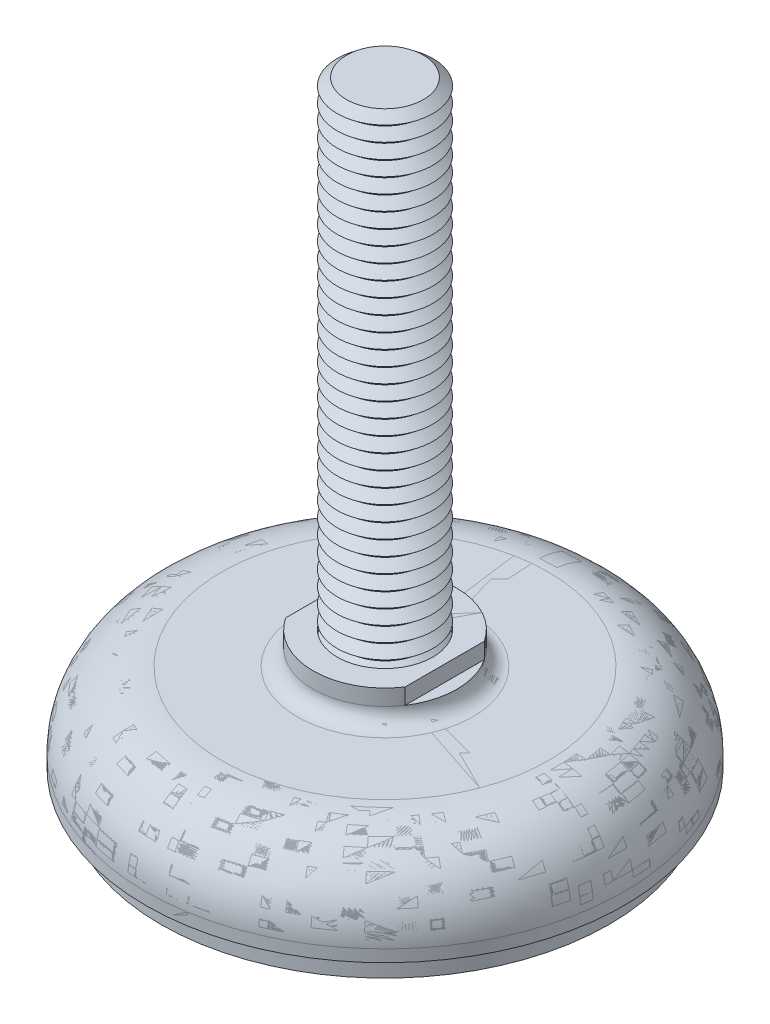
ISO-10303-21;
HEADER;
FILE_DESCRIPTION(('STEP AP214'),'2;1');
FILE_NAME('part.step','',(''),(''),'','','');
FILE_SCHEMA(('AUTOMOTIVE_DESIGN { 1 0 10303 214 1 1 1 1 }'));
ENDSEC;
DATA;
#1=APPLICATION_CONTEXT('core data for automotive mechanical design processes');
#2=APPLICATION_PROTOCOL_DEFINITION('international standard','automotive_design',2000,#1);
#3=PRODUCT_CONTEXT('',#1,'mechanical');
#4=PRODUCT('Part','Part','',(#3));
#5=PRODUCT_RELATED_PRODUCT_CATEGORY('part','',(#4));
#6=PRODUCT_DEFINITION_FORMATION('','',#4);
#7=PRODUCT_DEFINITION_CONTEXT('part definition',#1,'design');
#8=PRODUCT_DEFINITION('design','',#6,#7);
#9=PRODUCT_DEFINITION_SHAPE('','',#8);
#10=(LENGTH_UNIT() NAMED_UNIT(*) SI_UNIT(.MILLI.,.METRE.));
#11=(NAMED_UNIT(*) PLANE_ANGLE_UNIT() SI_UNIT($,.RADIAN.));
#12=(NAMED_UNIT(*) SI_UNIT($,.STERADIAN.) SOLID_ANGLE_UNIT());
#13=UNCERTAINTY_MEASURE_WITH_UNIT(LENGTH_MEASURE(1.E-05),#10,'distance_accuracy_value','');
#14=(GEOMETRIC_REPRESENTATION_CONTEXT(3) GLOBAL_UNCERTAINTY_ASSIGNED_CONTEXT((#13)) GLOBAL_UNIT_ASSIGNED_CONTEXT((#10,
#11,#12)) REPRESENTATION_CONTEXT('',''));
#15=CARTESIAN_POINT('',(0.,0.,0.));
#16=DIRECTION('',(0.,0.,1.));
#17=DIRECTION('',(1.,0.,0.));
#18=AXIS2_PLACEMENT_3D('',#15,#16,#17);
#19=CARTESIAN_POINT('',(0.,47.75,0.));
#20=DIRECTION('',(0.,-1.,0.));
#21=DIRECTION('',(0.998136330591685,0.,-0.0610234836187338));
#22=AXIS2_PLACEMENT_3D('',#19,#20,#21);
#23=CONICAL_SURFACE('',#22,3.2193752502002,0.895664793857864);
#24=CARTESIAN_POINT('',(0.,47.125,0.));
#25=DIRECTION('',(0.,-1.,0.));
#26=DIRECTION('',(0.998136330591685,0.,-0.0610234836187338));
#27=AXIS2_PLACEMENT_3D('',#24,#25,#26);
#28=CIRCLE('',#27,4.);
#29=CARTESIAN_POINT('',(3.99254532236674,47.125,-0.244093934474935));
#30=VERTEX_POINT('',#29);
#31=EDGE_CURVE('P0_E37',#30,#30,#28,.T.);
#32=ORIENTED_EDGE('',*,*,#31,.F.);
#33=EDGE_LOOP('',(#32));
#34=FACE_BOUND('',#33,.T.);
#35=CARTESIAN_POINT('',(0.,47.75,0.));
#36=DIRECTION('',(0.,-1.,0.));
#37=DIRECTION('',(0.998136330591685,0.,-0.0610234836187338));
#38=AXIS2_PLACEMENT_3D('',#35,#36,#37);
#39=CIRCLE('',#38,3.2193752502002);
#40=CARTESIAN_POINT('',(3.21337539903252,47.75,-0.196457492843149));
#41=VERTEX_POINT('',#40);
#42=EDGE_CURVE('P0_E25',#41,#41,#39,.T.);
#43=ORIENTED_EDGE('',*,*,#42,.T.);
#44=EDGE_LOOP('',(#43));
#45=FACE_BOUND('',#44,.T.);
#46=ADVANCED_FACE('P0_F14',(#34,#45),#23,.T.);
#47=CARTESIAN_POINT('',(0.,48.375,0.));
#48=DIRECTION('',(0.,1.,0.));
#49=DIRECTION('',(-0.998136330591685,0.,0.0610234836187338));
#50=AXIS2_PLACEMENT_3D('',#47,#48,#49);
#51=CONICAL_SURFACE('',#50,4.,0.895664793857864);
#52=ORIENTED_EDGE('',*,*,#42,.F.);
#53=EDGE_LOOP('',(#52));
#54=FACE_BOUND('',#53,.T.);
#55=CARTESIAN_POINT('',(0.,48.375,0.));
#56=DIRECTION('',(0.,-1.,0.));
#57=DIRECTION('',(0.998136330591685,0.,-0.0610234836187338));
#58=AXIS2_PLACEMENT_3D('',#55,#56,#57);
#59=CIRCLE('',#58,4.);
#60=CARTESIAN_POINT('',(3.99254532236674,48.375,-0.244093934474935));
#61=VERTEX_POINT('',#60);
#62=EDGE_CURVE('P0_E29',#61,#61,#59,.T.);
#63=ORIENTED_EDGE('',*,*,#62,.T.);
#64=EDGE_LOOP('',(#63));
#65=FACE_BOUND('',#64,.T.);
#66=ADVANCED_FACE('P0_F673',(#54,#65),#51,.T.);
#67=CARTESIAN_POINT('',(0.,49.,0.));
#68=DIRECTION('',(0.,1.,0.));
#69=DIRECTION('',(-0.998136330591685,0.,0.0610234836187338));
#70=AXIS2_PLACEMENT_3D('',#67,#68,#69);
#71=PLANE('',#70);
#72=CARTESIAN_POINT('',(0.,49.,0.));
#73=DIRECTION('',(0.,-1.,0.));
#74=DIRECTION('',(0.998136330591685,0.,-0.0610234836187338));
#75=AXIS2_PLACEMENT_3D('',#72,#73,#74);
#76=CIRCLE('',#75,3.2193752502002);
#77=CARTESIAN_POINT('',(3.21337539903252,49.,-0.196457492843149));
#78=VERTEX_POINT('',#77);
#79=EDGE_CURVE('P0_E21',#78,#78,#76,.T.);
#80=ORIENTED_EDGE('',*,*,#79,.F.);
#81=EDGE_LOOP('',(#80));
#82=FACE_BOUND('',#81,.T.);
#83=ADVANCED_FACE('P0_F679',(#82),#71,.T.);
#84=CARTESIAN_POINT('',(0.,49.,0.));
#85=DIRECTION('',(0.,-1.,0.));
#86=DIRECTION('',(0.998136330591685,0.,-0.0610234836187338));
#87=AXIS2_PLACEMENT_3D('',#84,#85,#86);
#88=CONICAL_SURFACE('',#87,3.2193752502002,0.895664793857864);
#89=ORIENTED_EDGE('',*,*,#62,.F.);
#90=EDGE_LOOP('',(#89));
#91=FACE_BOUND('',#90,.T.);
#92=ORIENTED_EDGE('',*,*,#79,.T.);
#93=EDGE_LOOP('',(#92));
#94=FACE_BOUND('',#93,.T.);
#95=ADVANCED_FACE('P0_F662',(#91,#94),#88,.T.);
#96=CARTESIAN_POINT('',(0.,46.5,0.));
#97=DIRECTION('',(0.,-1.,0.));
#98=DIRECTION('',(0.998136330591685,0.,-0.0610234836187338));
#99=AXIS2_PLACEMENT_3D('',#96,#97,#98);
#100=CONICAL_SURFACE('',#99,3.2193752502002,0.895664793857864);
#101=CARTESIAN_POINT('',(0.,45.875,0.));
#102=DIRECTION('',(0.,-1.,0.));
#103=DIRECTION('',(0.998136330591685,0.,-0.0610234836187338));
#104=AXIS2_PLACEMENT_3D('',#101,#102,#103);
#105=CIRCLE('',#104,4.);
#106=CARTESIAN_POINT('',(3.99254532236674,45.875,-0.244093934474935));
#107=VERTEX_POINT('',#106);
#108=EDGE_CURVE('P0_E43',#107,#107,#105,.T.);
#109=ORIENTED_EDGE('',*,*,#108,.F.);
#110=EDGE_LOOP('',(#109));
#111=FACE_BOUND('',#110,.T.);
#112=CARTESIAN_POINT('',(0.,46.5,0.));
#113=DIRECTION('',(0.,-1.,0.));
#114=DIRECTION('',(0.998136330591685,0.,-0.0610234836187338));
#115=AXIS2_PLACEMENT_3D('',#112,#113,#114);
#116=CIRCLE('',#115,3.2193752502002);
#117=CARTESIAN_POINT('',(3.21337539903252,46.5,-0.196457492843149));
#118=VERTEX_POINT('',#117);
#119=EDGE_CURVE('P0_E34',#118,#118,#116,.T.);
#120=ORIENTED_EDGE('',*,*,#119,.T.);
#121=EDGE_LOOP('',(#120));
#122=FACE_BOUND('',#121,.T.);
#123=ADVANCED_FACE('P0_F659',(#111,#122),#100,.T.);
#124=CARTESIAN_POINT('',(0.,47.125,0.));
#125=DIRECTION('',(0.,1.,0.));
#126=DIRECTION('',(-0.998136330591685,0.,0.0610234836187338));
#127=AXIS2_PLACEMENT_3D('',#124,#125,#126);
#128=CONICAL_SURFACE('',#127,4.,0.895664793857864);
#129=ORIENTED_EDGE('',*,*,#119,.F.);
#130=EDGE_LOOP('',(#129));
#131=FACE_BOUND('',#130,.T.);
#132=ORIENTED_EDGE('',*,*,#31,.T.);
#133=EDGE_LOOP('',(#132));
#134=FACE_BOUND('',#133,.T.);
#135=ADVANCED_FACE('P0_F650',(#131,#134),#128,.T.);
#136=CARTESIAN_POINT('',(0.,45.25,0.));
#137=DIRECTION('',(0.,-1.,0.));
#138=DIRECTION('',(0.998136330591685,0.,-0.0610234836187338));
#139=AXIS2_PLACEMENT_3D('',#136,#137,#138);
#140=CONICAL_SURFACE('',#139,3.2193752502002,0.895664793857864);
#141=CARTESIAN_POINT('',(0.,44.625,0.));
#142=DIRECTION('',(0.,-1.,0.));
#143=DIRECTION('',(0.998136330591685,0.,-0.0610234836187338));
#144=AXIS2_PLACEMENT_3D('',#141,#142,#143);
#145=CIRCLE('',#144,4.);
#146=CARTESIAN_POINT('',(3.99254532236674,44.625,-0.244093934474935));
#147=VERTEX_POINT('',#146);
#148=EDGE_CURVE('P0_E49',#147,#147,#145,.T.);
#149=ORIENTED_EDGE('',*,*,#148,.F.);
#150=EDGE_LOOP('',(#149));
#151=FACE_BOUND('',#150,.T.);
#152=CARTESIAN_POINT('',(0.,45.25,0.));
#153=DIRECTION('',(0.,-1.,0.));
#154=DIRECTION('',(0.998136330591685,0.,-0.0610234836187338));
#155=AXIS2_PLACEMENT_3D('',#152,#153,#154);
#156=CIRCLE('',#155,3.2193752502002);
#157=CARTESIAN_POINT('',(3.21337539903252,45.25,-0.196457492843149));
#158=VERTEX_POINT('',#157);
#159=EDGE_CURVE('P0_E40',#158,#158,#156,.T.);
#160=ORIENTED_EDGE('',*,*,#159,.T.);
#161=EDGE_LOOP('',(#160));
#162=FACE_BOUND('',#161,.T.);
#163=ADVANCED_FACE('P0_F647',(#151,#162),#140,.T.);
#164=CARTESIAN_POINT('',(0.,45.875,0.));
#165=DIRECTION('',(0.,1.,0.));
#166=DIRECTION('',(-0.998136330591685,0.,0.0610234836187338));
#167=AXIS2_PLACEMENT_3D('',#164,#165,#166);
#168=CONICAL_SURFACE('',#167,4.,0.895664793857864);
#169=ORIENTED_EDGE('',*,*,#159,.F.);
#170=EDGE_LOOP('',(#169));
#171=FACE_BOUND('',#170,.T.);
#172=ORIENTED_EDGE('',*,*,#108,.T.);
#173=EDGE_LOOP('',(#172));
#174=FACE_BOUND('',#173,.T.);
#175=ADVANCED_FACE('P0_F638',(#171,#174),#168,.T.);
#176=CARTESIAN_POINT('',(0.,44.,0.));
#177=DIRECTION('',(0.,-1.,0.));
#178=DIRECTION('',(0.998136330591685,0.,-0.0610234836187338));
#179=AXIS2_PLACEMENT_3D('',#176,#177,#178);
#180=CONICAL_SURFACE('',#179,3.2193752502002,0.895664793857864);
#181=CARTESIAN_POINT('',(0.,43.375,0.));
#182=DIRECTION('',(0.,-1.,0.));
#183=DIRECTION('',(0.998136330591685,0.,-0.0610234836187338));
#184=AXIS2_PLACEMENT_3D('',#181,#182,#183);
#185=CIRCLE('',#184,4.);
#186=CARTESIAN_POINT('',(3.99254532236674,43.375,-0.244093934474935));
#187=VERTEX_POINT('',#186);
#188=EDGE_CURVE('P0_E55',#187,#187,#185,.T.);
#189=ORIENTED_EDGE('',*,*,#188,.F.);
#190=EDGE_LOOP('',(#189));
#191=FACE_BOUND('',#190,.T.);
#192=CARTESIAN_POINT('',(0.,44.,0.));
#193=DIRECTION('',(0.,-1.,0.));
#194=DIRECTION('',(0.998136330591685,0.,-0.0610234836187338));
#195=AXIS2_PLACEMENT_3D('',#192,#193,#194);
#196=CIRCLE('',#195,3.2193752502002);
#197=CARTESIAN_POINT('',(3.21337539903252,44.,-0.196457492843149));
#198=VERTEX_POINT('',#197);
#199=EDGE_CURVE('P0_E46',#198,#198,#196,.T.);
#200=ORIENTED_EDGE('',*,*,#199,.T.);
#201=EDGE_LOOP('',(#200));
#202=FACE_BOUND('',#201,.T.);
#203=ADVANCED_FACE('P0_F635',(#191,#202),#180,.T.);
#204=CARTESIAN_POINT('',(0.,44.625,0.));
#205=DIRECTION('',(0.,1.,0.));
#206=DIRECTION('',(-0.998136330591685,0.,0.0610234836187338));
#207=AXIS2_PLACEMENT_3D('',#204,#205,#206);
#208=CONICAL_SURFACE('',#207,4.,0.895664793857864);
#209=ORIENTED_EDGE('',*,*,#199,.F.);
#210=EDGE_LOOP('',(#209));
#211=FACE_BOUND('',#210,.T.);
#212=ORIENTED_EDGE('',*,*,#148,.T.);
#213=EDGE_LOOP('',(#212));
#214=FACE_BOUND('',#213,.T.);
#215=ADVANCED_FACE('P0_F626',(#211,#214),#208,.T.);
#216=CARTESIAN_POINT('',(0.,42.75,0.));
#217=DIRECTION('',(0.,-1.,0.));
#218=DIRECTION('',(0.998136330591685,0.,-0.0610234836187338));
#219=AXIS2_PLACEMENT_3D('',#216,#217,#218);
#220=CONICAL_SURFACE('',#219,3.2193752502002,0.895664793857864);
#221=CARTESIAN_POINT('',(0.,42.125,0.));
#222=DIRECTION('',(0.,-1.,0.));
#223=DIRECTION('',(0.998136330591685,0.,-0.0610234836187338));
#224=AXIS2_PLACEMENT_3D('',#221,#222,#223);
#225=CIRCLE('',#224,4.);
#226=CARTESIAN_POINT('',(3.99254532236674,42.125,-0.244093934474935));
#227=VERTEX_POINT('',#226);
#228=EDGE_CURVE('P0_E61',#227,#227,#225,.T.);
#229=ORIENTED_EDGE('',*,*,#228,.F.);
#230=EDGE_LOOP('',(#229));
#231=FACE_BOUND('',#230,.T.);
#232=CARTESIAN_POINT('',(0.,42.75,0.));
#233=DIRECTION('',(0.,-1.,0.));
#234=DIRECTION('',(0.998136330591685,0.,-0.0610234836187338));
#235=AXIS2_PLACEMENT_3D('',#232,#233,#234);
#236=CIRCLE('',#235,3.2193752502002);
#237=CARTESIAN_POINT('',(3.21337539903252,42.75,-0.196457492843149));
#238=VERTEX_POINT('',#237);
#239=EDGE_CURVE('P0_E52',#238,#238,#236,.T.);
#240=ORIENTED_EDGE('',*,*,#239,.T.);
#241=EDGE_LOOP('',(#240));
#242=FACE_BOUND('',#241,.T.);
#243=ADVANCED_FACE('P0_F623',(#231,#242),#220,.T.);
#244=CARTESIAN_POINT('',(0.,43.375,0.));
#245=DIRECTION('',(0.,1.,0.));
#246=DIRECTION('',(-0.998136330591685,0.,0.0610234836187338));
#247=AXIS2_PLACEMENT_3D('',#244,#245,#246);
#248=CONICAL_SURFACE('',#247,4.,0.895664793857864);
#249=ORIENTED_EDGE('',*,*,#239,.F.);
#250=EDGE_LOOP('',(#249));
#251=FACE_BOUND('',#250,.T.);
#252=ORIENTED_EDGE('',*,*,#188,.T.);
#253=EDGE_LOOP('',(#252));
#254=FACE_BOUND('',#253,.T.);
#255=ADVANCED_FACE('P0_F614',(#251,#254),#248,.T.);
#256=CARTESIAN_POINT('',(0.,41.5,0.));
#257=DIRECTION('',(0.,-1.,0.));
#258=DIRECTION('',(0.998136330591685,0.,-0.0610234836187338));
#259=AXIS2_PLACEMENT_3D('',#256,#257,#258);
#260=CONICAL_SURFACE('',#259,3.2193752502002,0.895664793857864);
#261=CARTESIAN_POINT('',(0.,40.875,0.));
#262=DIRECTION('',(0.,-1.,0.));
#263=DIRECTION('',(0.998136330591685,0.,-0.0610234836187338));
#264=AXIS2_PLACEMENT_3D('',#261,#262,#263);
#265=CIRCLE('',#264,4.);
#266=CARTESIAN_POINT('',(3.99254532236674,40.875,-0.244093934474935));
#267=VERTEX_POINT('',#266);
#268=EDGE_CURVE('P0_E67',#267,#267,#265,.T.);
#269=ORIENTED_EDGE('',*,*,#268,.F.);
#270=EDGE_LOOP('',(#269));
#271=FACE_BOUND('',#270,.T.);
#272=CARTESIAN_POINT('',(0.,41.5,0.));
#273=DIRECTION('',(0.,-1.,0.));
#274=DIRECTION('',(0.998136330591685,0.,-0.0610234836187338));
#275=AXIS2_PLACEMENT_3D('',#272,#273,#274);
#276=CIRCLE('',#275,3.2193752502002);
#277=CARTESIAN_POINT('',(3.21337539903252,41.5,-0.196457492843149));
#278=VERTEX_POINT('',#277);
#279=EDGE_CURVE('P0_E58',#278,#278,#276,.T.);
#280=ORIENTED_EDGE('',*,*,#279,.T.);
#281=EDGE_LOOP('',(#280));
#282=FACE_BOUND('',#281,.T.);
#283=ADVANCED_FACE('P0_F611',(#271,#282),#260,.T.);
#284=CARTESIAN_POINT('',(0.,42.125,0.));
#285=DIRECTION('',(0.,1.,0.));
#286=DIRECTION('',(-0.998136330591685,0.,0.0610234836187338));
#287=AXIS2_PLACEMENT_3D('',#284,#285,#286);
#288=CONICAL_SURFACE('',#287,4.,0.895664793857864);
#289=ORIENTED_EDGE('',*,*,#279,.F.);
#290=EDGE_LOOP('',(#289));
#291=FACE_BOUND('',#290,.T.);
#292=ORIENTED_EDGE('',*,*,#228,.T.);
#293=EDGE_LOOP('',(#292));
#294=FACE_BOUND('',#293,.T.);
#295=ADVANCED_FACE('P0_F602',(#291,#294),#288,.T.);
#296=CARTESIAN_POINT('',(0.,40.25,0.));
#297=DIRECTION('',(0.,-1.,0.));
#298=DIRECTION('',(0.998136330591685,0.,-0.0610234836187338));
#299=AXIS2_PLACEMENT_3D('',#296,#297,#298);
#300=CONICAL_SURFACE('',#299,3.2193752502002,0.895664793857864);
#301=CARTESIAN_POINT('',(0.,39.625,0.));
#302=DIRECTION('',(0.,-1.,0.));
#303=DIRECTION('',(0.998136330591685,0.,-0.0610234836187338));
#304=AXIS2_PLACEMENT_3D('',#301,#302,#303);
#305=CIRCLE('',#304,4.);
#306=CARTESIAN_POINT('',(3.99254532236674,39.625,-0.244093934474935));
#307=VERTEX_POINT('',#306);
#308=EDGE_CURVE('P0_E73',#307,#307,#305,.T.);
#309=ORIENTED_EDGE('',*,*,#308,.F.);
#310=EDGE_LOOP('',(#309));
#311=FACE_BOUND('',#310,.T.);
#312=CARTESIAN_POINT('',(0.,40.25,0.));
#313=DIRECTION('',(0.,-1.,0.));
#314=DIRECTION('',(0.998136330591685,0.,-0.0610234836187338));
#315=AXIS2_PLACEMENT_3D('',#312,#313,#314);
#316=CIRCLE('',#315,3.2193752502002);
#317=CARTESIAN_POINT('',(3.21337539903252,40.25,-0.196457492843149));
#318=VERTEX_POINT('',#317);
#319=EDGE_CURVE('P0_E64',#318,#318,#316,.T.);
#320=ORIENTED_EDGE('',*,*,#319,.T.);
#321=EDGE_LOOP('',(#320));
#322=FACE_BOUND('',#321,.T.);
#323=ADVANCED_FACE('P0_F599',(#311,#322),#300,.T.);
#324=CARTESIAN_POINT('',(0.,40.875,0.));
#325=DIRECTION('',(0.,1.,0.));
#326=DIRECTION('',(-0.998136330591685,0.,0.0610234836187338));
#327=AXIS2_PLACEMENT_3D('',#324,#325,#326);
#328=CONICAL_SURFACE('',#327,4.,0.895664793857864);
#329=ORIENTED_EDGE('',*,*,#319,.F.);
#330=EDGE_LOOP('',(#329));
#331=FACE_BOUND('',#330,.T.);
#332=ORIENTED_EDGE('',*,*,#268,.T.);
#333=EDGE_LOOP('',(#332));
#334=FACE_BOUND('',#333,.T.);
#335=ADVANCED_FACE('P0_F590',(#331,#334),#328,.T.);
#336=CARTESIAN_POINT('',(0.,39.,0.));
#337=DIRECTION('',(0.,-1.,0.));
#338=DIRECTION('',(0.998136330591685,0.,-0.0610234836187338));
#339=AXIS2_PLACEMENT_3D('',#336,#337,#338);
#340=CONICAL_SURFACE('',#339,3.2193752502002,0.895664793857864);
#341=CARTESIAN_POINT('',(0.,38.375,0.));
#342=DIRECTION('',(0.,-1.,0.));
#343=DIRECTION('',(0.998136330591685,0.,-0.0610234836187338));
#344=AXIS2_PLACEMENT_3D('',#341,#342,#343);
#345=CIRCLE('',#344,4.);
#346=CARTESIAN_POINT('',(3.99254532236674,38.375,-0.244093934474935));
#347=VERTEX_POINT('',#346);
#348=EDGE_CURVE('P0_E79',#347,#347,#345,.T.);
#349=ORIENTED_EDGE('',*,*,#348,.F.);
#350=EDGE_LOOP('',(#349));
#351=FACE_BOUND('',#350,.T.);
#352=CARTESIAN_POINT('',(0.,39.,0.));
#353=DIRECTION('',(0.,-1.,0.));
#354=DIRECTION('',(0.998136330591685,0.,-0.0610234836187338));
#355=AXIS2_PLACEMENT_3D('',#352,#353,#354);
#356=CIRCLE('',#355,3.2193752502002);
#357=CARTESIAN_POINT('',(3.21337539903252,39.,-0.196457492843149));
#358=VERTEX_POINT('',#357);
#359=EDGE_CURVE('P0_E70',#358,#358,#356,.T.);
#360=ORIENTED_EDGE('',*,*,#359,.T.);
#361=EDGE_LOOP('',(#360));
#362=FACE_BOUND('',#361,.T.);
#363=ADVANCED_FACE('P0_F587',(#351,#362),#340,.T.);
#364=CARTESIAN_POINT('',(0.,39.625,0.));
#365=DIRECTION('',(0.,1.,0.));
#366=DIRECTION('',(-0.998136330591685,0.,0.0610234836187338));
#367=AXIS2_PLACEMENT_3D('',#364,#365,#366);
#368=CONICAL_SURFACE('',#367,4.,0.895664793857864);
#369=ORIENTED_EDGE('',*,*,#359,.F.);
#370=EDGE_LOOP('',(#369));
#371=FACE_BOUND('',#370,.T.);
#372=ORIENTED_EDGE('',*,*,#308,.T.);
#373=EDGE_LOOP('',(#372));
#374=FACE_BOUND('',#373,.T.);
#375=ADVANCED_FACE('P0_F578',(#371,#374),#368,.T.);
#376=CARTESIAN_POINT('',(0.,37.75,0.));
#377=DIRECTION('',(0.,-1.,0.));
#378=DIRECTION('',(0.998136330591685,0.,-0.0610234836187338));
#379=AXIS2_PLACEMENT_3D('',#376,#377,#378);
#380=CONICAL_SURFACE('',#379,3.2193752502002,0.895664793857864);
#381=CARTESIAN_POINT('',(0.,37.125,0.));
#382=DIRECTION('',(0.,-1.,0.));
#383=DIRECTION('',(0.998136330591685,0.,-0.0610234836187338));
#384=AXIS2_PLACEMENT_3D('',#381,#382,#383);
#385=CIRCLE('',#384,4.);
#386=CARTESIAN_POINT('',(3.99254532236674,37.125,-0.244093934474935));
#387=VERTEX_POINT('',#386);
#388=EDGE_CURVE('P0_E85',#387,#387,#385,.T.);
#389=ORIENTED_EDGE('',*,*,#388,.F.);
#390=EDGE_LOOP('',(#389));
#391=FACE_BOUND('',#390,.T.);
#392=CARTESIAN_POINT('',(0.,37.75,0.));
#393=DIRECTION('',(0.,-1.,0.));
#394=DIRECTION('',(0.998136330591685,0.,-0.0610234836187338));
#395=AXIS2_PLACEMENT_3D('',#392,#393,#394);
#396=CIRCLE('',#395,3.2193752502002);
#397=CARTESIAN_POINT('',(3.21337539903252,37.75,-0.196457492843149));
#398=VERTEX_POINT('',#397);
#399=EDGE_CURVE('P0_E76',#398,#398,#396,.T.);
#400=ORIENTED_EDGE('',*,*,#399,.T.);
#401=EDGE_LOOP('',(#400));
#402=FACE_BOUND('',#401,.T.);
#403=ADVANCED_FACE('P0_F575',(#391,#402),#380,.T.);
#404=CARTESIAN_POINT('',(0.,38.375,0.));
#405=DIRECTION('',(0.,1.,0.));
#406=DIRECTION('',(-0.998136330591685,0.,0.0610234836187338));
#407=AXIS2_PLACEMENT_3D('',#404,#405,#406);
#408=CONICAL_SURFACE('',#407,4.,0.895664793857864);
#409=ORIENTED_EDGE('',*,*,#399,.F.);
#410=EDGE_LOOP('',(#409));
#411=FACE_BOUND('',#410,.T.);
#412=ORIENTED_EDGE('',*,*,#348,.T.);
#413=EDGE_LOOP('',(#412));
#414=FACE_BOUND('',#413,.T.);
#415=ADVANCED_FACE('P0_F566',(#411,#414),#408,.T.);
#416=CARTESIAN_POINT('',(0.,36.5,0.));
#417=DIRECTION('',(0.,-1.,0.));
#418=DIRECTION('',(0.998136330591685,0.,-0.0610234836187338));
#419=AXIS2_PLACEMENT_3D('',#416,#417,#418);
#420=CONICAL_SURFACE('',#419,3.2193752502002,0.895664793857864);
#421=CARTESIAN_POINT('',(0.,35.875,0.));
#422=DIRECTION('',(0.,-1.,0.));
#423=DIRECTION('',(0.998136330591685,0.,-0.0610234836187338));
#424=AXIS2_PLACEMENT_3D('',#421,#422,#423);
#425=CIRCLE('',#424,4.);
#426=CARTESIAN_POINT('',(3.99254532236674,35.875,-0.244093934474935));
#427=VERTEX_POINT('',#426);
#428=EDGE_CURVE('P0_E91',#427,#427,#425,.T.);
#429=ORIENTED_EDGE('',*,*,#428,.F.);
#430=EDGE_LOOP('',(#429));
#431=FACE_BOUND('',#430,.T.);
#432=CARTESIAN_POINT('',(0.,36.5,0.));
#433=DIRECTION('',(0.,-1.,0.));
#434=DIRECTION('',(0.998136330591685,0.,-0.0610234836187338));
#435=AXIS2_PLACEMENT_3D('',#432,#433,#434);
#436=CIRCLE('',#435,3.2193752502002);
#437=CARTESIAN_POINT('',(3.21337539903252,36.5,-0.196457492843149));
#438=VERTEX_POINT('',#437);
#439=EDGE_CURVE('P0_E82',#438,#438,#436,.T.);
#440=ORIENTED_EDGE('',*,*,#439,.T.);
#441=EDGE_LOOP('',(#440));
#442=FACE_BOUND('',#441,.T.);
#443=ADVANCED_FACE('P0_F563',(#431,#442),#420,.T.);
#444=CARTESIAN_POINT('',(0.,37.125,0.));
#445=DIRECTION('',(0.,1.,0.));
#446=DIRECTION('',(-0.998136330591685,0.,0.0610234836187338));
#447=AXIS2_PLACEMENT_3D('',#444,#445,#446);
#448=CONICAL_SURFACE('',#447,4.,0.895664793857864);
#449=ORIENTED_EDGE('',*,*,#439,.F.);
#450=EDGE_LOOP('',(#449));
#451=FACE_BOUND('',#450,.T.);
#452=ORIENTED_EDGE('',*,*,#388,.T.);
#453=EDGE_LOOP('',(#452));
#454=FACE_BOUND('',#453,.T.);
#455=ADVANCED_FACE('P0_F554',(#451,#454),#448,.T.);
#456=CARTESIAN_POINT('',(0.,35.25,0.));
#457=DIRECTION('',(0.,-1.,0.));
#458=DIRECTION('',(0.998136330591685,0.,-0.0610234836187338));
#459=AXIS2_PLACEMENT_3D('',#456,#457,#458);
#460=CONICAL_SURFACE('',#459,3.2193752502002,0.895664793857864);
#461=CARTESIAN_POINT('',(0.,34.625,0.));
#462=DIRECTION('',(0.,-1.,0.));
#463=DIRECTION('',(0.998136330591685,0.,-0.0610234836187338));
#464=AXIS2_PLACEMENT_3D('',#461,#462,#463);
#465=CIRCLE('',#464,4.);
#466=CARTESIAN_POINT('',(3.99254532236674,34.625,-0.244093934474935));
#467=VERTEX_POINT('',#466);
#468=EDGE_CURVE('P0_E97',#467,#467,#465,.T.);
#469=ORIENTED_EDGE('',*,*,#468,.F.);
#470=EDGE_LOOP('',(#469));
#471=FACE_BOUND('',#470,.T.);
#472=CARTESIAN_POINT('',(0.,35.25,0.));
#473=DIRECTION('',(0.,-1.,0.));
#474=DIRECTION('',(0.998136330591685,0.,-0.0610234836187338));
#475=AXIS2_PLACEMENT_3D('',#472,#473,#474);
#476=CIRCLE('',#475,3.2193752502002);
#477=CARTESIAN_POINT('',(3.21337539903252,35.25,-0.196457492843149));
#478=VERTEX_POINT('',#477);
#479=EDGE_CURVE('P0_E88',#478,#478,#476,.T.);
#480=ORIENTED_EDGE('',*,*,#479,.T.);
#481=EDGE_LOOP('',(#480));
#482=FACE_BOUND('',#481,.T.);
#483=ADVANCED_FACE('P0_F551',(#471,#482),#460,.T.);
#484=CARTESIAN_POINT('',(0.,35.875,0.));
#485=DIRECTION('',(0.,1.,0.));
#486=DIRECTION('',(-0.998136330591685,0.,0.0610234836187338));
#487=AXIS2_PLACEMENT_3D('',#484,#485,#486);
#488=CONICAL_SURFACE('',#487,4.,0.895664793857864);
#489=ORIENTED_EDGE('',*,*,#479,.F.);
#490=EDGE_LOOP('',(#489));
#491=FACE_BOUND('',#490,.T.);
#492=ORIENTED_EDGE('',*,*,#428,.T.);
#493=EDGE_LOOP('',(#492));
#494=FACE_BOUND('',#493,.T.);
#495=ADVANCED_FACE('P0_F542',(#491,#494),#488,.T.);
#496=CARTESIAN_POINT('',(0.,34.,0.));
#497=DIRECTION('',(0.,-1.,0.));
#498=DIRECTION('',(0.998136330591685,0.,-0.0610234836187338));
#499=AXIS2_PLACEMENT_3D('',#496,#497,#498);
#500=CONICAL_SURFACE('',#499,3.2193752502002,0.895664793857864);
#501=CARTESIAN_POINT('',(0.,33.375,0.));
#502=DIRECTION('',(0.,-1.,0.));
#503=DIRECTION('',(0.998136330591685,0.,-0.0610234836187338));
#504=AXIS2_PLACEMENT_3D('',#501,#502,#503);
#505=CIRCLE('',#504,4.);
#506=CARTESIAN_POINT('',(3.99254532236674,33.375,-0.244093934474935));
#507=VERTEX_POINT('',#506);
#508=EDGE_CURVE('P0_E103',#507,#507,#505,.T.);
#509=ORIENTED_EDGE('',*,*,#508,.F.);
#510=EDGE_LOOP('',(#509));
#511=FACE_BOUND('',#510,.T.);
#512=CARTESIAN_POINT('',(0.,34.,0.));
#513=DIRECTION('',(0.,-1.,0.));
#514=DIRECTION('',(0.998136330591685,0.,-0.0610234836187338));
#515=AXIS2_PLACEMENT_3D('',#512,#513,#514);
#516=CIRCLE('',#515,3.2193752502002);
#517=CARTESIAN_POINT('',(3.21337539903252,34.,-0.196457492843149));
#518=VERTEX_POINT('',#517);
#519=EDGE_CURVE('P0_E94',#518,#518,#516,.T.);
#520=ORIENTED_EDGE('',*,*,#519,.T.);
#521=EDGE_LOOP('',(#520));
#522=FACE_BOUND('',#521,.T.);
#523=ADVANCED_FACE('P0_F539',(#511,#522),#500,.T.);
#524=CARTESIAN_POINT('',(0.,34.625,0.));
#525=DIRECTION('',(0.,1.,0.));
#526=DIRECTION('',(-0.998136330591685,0.,0.0610234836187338));
#527=AXIS2_PLACEMENT_3D('',#524,#525,#526);
#528=CONICAL_SURFACE('',#527,4.,0.895664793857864);
#529=ORIENTED_EDGE('',*,*,#519,.F.);
#530=EDGE_LOOP('',(#529));
#531=FACE_BOUND('',#530,.T.);
#532=ORIENTED_EDGE('',*,*,#468,.T.);
#533=EDGE_LOOP('',(#532));
#534=FACE_BOUND('',#533,.T.);
#535=ADVANCED_FACE('P0_F530',(#531,#534),#528,.T.);
#536=CARTESIAN_POINT('',(0.,32.75,0.));
#537=DIRECTION('',(0.,-1.,0.));
#538=DIRECTION('',(0.998136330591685,0.,-0.0610234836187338));
#539=AXIS2_PLACEMENT_3D('',#536,#537,#538);
#540=CONICAL_SURFACE('',#539,3.2193752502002,0.895664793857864);
#541=CARTESIAN_POINT('',(0.,32.125,0.));
#542=DIRECTION('',(0.,-1.,0.));
#543=DIRECTION('',(0.998136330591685,0.,-0.0610234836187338));
#544=AXIS2_PLACEMENT_3D('',#541,#542,#543);
#545=CIRCLE('',#544,4.);
#546=CARTESIAN_POINT('',(3.99254532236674,32.125,-0.244093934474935));
#547=VERTEX_POINT('',#546);
#548=EDGE_CURVE('P0_E109',#547,#547,#545,.T.);
#549=ORIENTED_EDGE('',*,*,#548,.F.);
#550=EDGE_LOOP('',(#549));
#551=FACE_BOUND('',#550,.T.);
#552=CARTESIAN_POINT('',(0.,32.75,0.));
#553=DIRECTION('',(0.,-1.,0.));
#554=DIRECTION('',(0.998136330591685,0.,-0.0610234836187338));
#555=AXIS2_PLACEMENT_3D('',#552,#553,#554);
#556=CIRCLE('',#555,3.2193752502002);
#557=CARTESIAN_POINT('',(3.21337539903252,32.75,-0.196457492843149));
#558=VERTEX_POINT('',#557);
#559=EDGE_CURVE('P0_E100',#558,#558,#556,.T.);
#560=ORIENTED_EDGE('',*,*,#559,.T.);
#561=EDGE_LOOP('',(#560));
#562=FACE_BOUND('',#561,.T.);
#563=ADVANCED_FACE('P0_F527',(#551,#562),#540,.T.);
#564=CARTESIAN_POINT('',(0.,33.375,0.));
#565=DIRECTION('',(0.,1.,0.));
#566=DIRECTION('',(-0.998136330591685,0.,0.0610234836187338));
#567=AXIS2_PLACEMENT_3D('',#564,#565,#566);
#568=CONICAL_SURFACE('',#567,4.,0.895664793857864);
#569=ORIENTED_EDGE('',*,*,#559,.F.);
#570=EDGE_LOOP('',(#569));
#571=FACE_BOUND('',#570,.T.);
#572=ORIENTED_EDGE('',*,*,#508,.T.);
#573=EDGE_LOOP('',(#572));
#574=FACE_BOUND('',#573,.T.);
#575=ADVANCED_FACE('P0_F518',(#571,#574),#568,.T.);
#576=CARTESIAN_POINT('',(0.,31.5,0.));
#577=DIRECTION('',(0.,-1.,0.));
#578=DIRECTION('',(0.998136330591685,0.,-0.0610234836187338));
#579=AXIS2_PLACEMENT_3D('',#576,#577,#578);
#580=CONICAL_SURFACE('',#579,3.2193752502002,0.895664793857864);
#581=CARTESIAN_POINT('',(0.,30.875,0.));
#582=DIRECTION('',(0.,-1.,0.));
#583=DIRECTION('',(0.998136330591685,0.,-0.0610234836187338));
#584=AXIS2_PLACEMENT_3D('',#581,#582,#583);
#585=CIRCLE('',#584,4.);
#586=CARTESIAN_POINT('',(3.99254532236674,30.875,-0.244093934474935));
#587=VERTEX_POINT('',#586);
#588=EDGE_CURVE('P0_E115',#587,#587,#585,.T.);
#589=ORIENTED_EDGE('',*,*,#588,.F.);
#590=EDGE_LOOP('',(#589));
#591=FACE_BOUND('',#590,.T.);
#592=CARTESIAN_POINT('',(0.,31.5,0.));
#593=DIRECTION('',(0.,-1.,0.));
#594=DIRECTION('',(0.998136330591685,0.,-0.0610234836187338));
#595=AXIS2_PLACEMENT_3D('',#592,#593,#594);
#596=CIRCLE('',#595,3.2193752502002);
#597=CARTESIAN_POINT('',(3.21337539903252,31.5,-0.196457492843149));
#598=VERTEX_POINT('',#597);
#599=EDGE_CURVE('P0_E106',#598,#598,#596,.T.);
#600=ORIENTED_EDGE('',*,*,#599,.T.);
#601=EDGE_LOOP('',(#600));
#602=FACE_BOUND('',#601,.T.);
#603=ADVANCED_FACE('P0_F515',(#591,#602),#580,.T.);
#604=CARTESIAN_POINT('',(0.,32.125,0.));
#605=DIRECTION('',(0.,1.,0.));
#606=DIRECTION('',(-0.998136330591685,0.,0.0610234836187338));
#607=AXIS2_PLACEMENT_3D('',#604,#605,#606);
#608=CONICAL_SURFACE('',#607,4.,0.895664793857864);
#609=ORIENTED_EDGE('',*,*,#599,.F.);
#610=EDGE_LOOP('',(#609));
#611=FACE_BOUND('',#610,.T.);
#612=ORIENTED_EDGE('',*,*,#548,.T.);
#613=EDGE_LOOP('',(#612));
#614=FACE_BOUND('',#613,.T.);
#615=ADVANCED_FACE('P0_F506',(#611,#614),#608,.T.);
#616=CARTESIAN_POINT('',(0.,30.25,0.));
#617=DIRECTION('',(0.,-1.,0.));
#618=DIRECTION('',(0.998136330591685,0.,-0.0610234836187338));
#619=AXIS2_PLACEMENT_3D('',#616,#617,#618);
#620=CONICAL_SURFACE('',#619,3.2193752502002,0.895664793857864);
#621=CARTESIAN_POINT('',(0.,29.625,0.));
#622=DIRECTION('',(0.,-1.,0.));
#623=DIRECTION('',(0.998136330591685,0.,-0.0610234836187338));
#624=AXIS2_PLACEMENT_3D('',#621,#622,#623);
#625=CIRCLE('',#624,4.);
#626=CARTESIAN_POINT('',(3.99254532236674,29.625,-0.244093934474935));
#627=VERTEX_POINT('',#626);
#628=EDGE_CURVE('P0_E121',#627,#627,#625,.T.);
#629=ORIENTED_EDGE('',*,*,#628,.F.);
#630=EDGE_LOOP('',(#629));
#631=FACE_BOUND('',#630,.T.);
#632=CARTESIAN_POINT('',(0.,30.25,0.));
#633=DIRECTION('',(0.,-1.,0.));
#634=DIRECTION('',(0.998136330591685,0.,-0.0610234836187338));
#635=AXIS2_PLACEMENT_3D('',#632,#633,#634);
#636=CIRCLE('',#635,3.2193752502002);
#637=CARTESIAN_POINT('',(3.21337539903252,30.25,-0.196457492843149));
#638=VERTEX_POINT('',#637);
#639=EDGE_CURVE('P0_E112',#638,#638,#636,.T.);
#640=ORIENTED_EDGE('',*,*,#639,.T.);
#641=EDGE_LOOP('',(#640));
#642=FACE_BOUND('',#641,.T.);
#643=ADVANCED_FACE('P0_F503',(#631,#642),#620,.T.);
#644=CARTESIAN_POINT('',(0.,30.875,0.));
#645=DIRECTION('',(0.,1.,0.));
#646=DIRECTION('',(-0.998136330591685,0.,0.0610234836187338));
#647=AXIS2_PLACEMENT_3D('',#644,#645,#646);
#648=CONICAL_SURFACE('',#647,4.,0.895664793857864);
#649=ORIENTED_EDGE('',*,*,#639,.F.);
#650=EDGE_LOOP('',(#649));
#651=FACE_BOUND('',#650,.T.);
#652=ORIENTED_EDGE('',*,*,#588,.T.);
#653=EDGE_LOOP('',(#652));
#654=FACE_BOUND('',#653,.T.);
#655=ADVANCED_FACE('P0_F494',(#651,#654),#648,.T.);
#656=CARTESIAN_POINT('',(0.,29.,0.));
#657=DIRECTION('',(0.,-1.,0.));
#658=DIRECTION('',(0.998136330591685,0.,-0.0610234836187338));
#659=AXIS2_PLACEMENT_3D('',#656,#657,#658);
#660=CONICAL_SURFACE('',#659,3.2193752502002,0.895664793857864);
#661=CARTESIAN_POINT('',(0.,28.375,0.));
#662=DIRECTION('',(0.,-1.,0.));
#663=DIRECTION('',(0.998136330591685,0.,-0.0610234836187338));
#664=AXIS2_PLACEMENT_3D('',#661,#662,#663);
#665=CIRCLE('',#664,4.);
#666=CARTESIAN_POINT('',(3.99254532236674,28.375,-0.244093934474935));
#667=VERTEX_POINT('',#666);
#668=EDGE_CURVE('P0_E127',#667,#667,#665,.T.);
#669=ORIENTED_EDGE('',*,*,#668,.F.);
#670=EDGE_LOOP('',(#669));
#671=FACE_BOUND('',#670,.T.);
#672=CARTESIAN_POINT('',(0.,29.,0.));
#673=DIRECTION('',(0.,-1.,0.));
#674=DIRECTION('',(0.998136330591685,0.,-0.0610234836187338));
#675=AXIS2_PLACEMENT_3D('',#672,#673,#674);
#676=CIRCLE('',#675,3.2193752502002);
#677=CARTESIAN_POINT('',(3.21337539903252,29.,-0.196457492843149));
#678=VERTEX_POINT('',#677);
#679=EDGE_CURVE('P0_E118',#678,#678,#676,.T.);
#680=ORIENTED_EDGE('',*,*,#679,.T.);
#681=EDGE_LOOP('',(#680));
#682=FACE_BOUND('',#681,.T.);
#683=ADVANCED_FACE('P0_F491',(#671,#682),#660,.T.);
#684=CARTESIAN_POINT('',(0.,29.625,0.));
#685=DIRECTION('',(0.,1.,0.));
#686=DIRECTION('',(-0.998136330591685,0.,0.0610234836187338));
#687=AXIS2_PLACEMENT_3D('',#684,#685,#686);
#688=CONICAL_SURFACE('',#687,4.,0.895664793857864);
#689=ORIENTED_EDGE('',*,*,#679,.F.);
#690=EDGE_LOOP('',(#689));
#691=FACE_BOUND('',#690,.T.);
#692=ORIENTED_EDGE('',*,*,#628,.T.);
#693=EDGE_LOOP('',(#692));
#694=FACE_BOUND('',#693,.T.);
#695=ADVANCED_FACE('P0_F482',(#691,#694),#688,.T.);
#696=CARTESIAN_POINT('',(0.,27.75,0.));
#697=DIRECTION('',(0.,-1.,0.));
#698=DIRECTION('',(0.998136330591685,0.,-0.0610234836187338));
#699=AXIS2_PLACEMENT_3D('',#696,#697,#698);
#700=CONICAL_SURFACE('',#699,3.2193752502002,0.895664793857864);
#701=CARTESIAN_POINT('',(0.,27.125,0.));
#702=DIRECTION('',(0.,-1.,0.));
#703=DIRECTION('',(0.998136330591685,0.,-0.0610234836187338));
#704=AXIS2_PLACEMENT_3D('',#701,#702,#703);
#705=CIRCLE('',#704,4.);
#706=CARTESIAN_POINT('',(3.99254532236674,27.125,-0.244093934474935));
#707=VERTEX_POINT('',#706);
#708=EDGE_CURVE('P0_E133',#707,#707,#705,.T.);
#709=ORIENTED_EDGE('',*,*,#708,.F.);
#710=EDGE_LOOP('',(#709));
#711=FACE_BOUND('',#710,.T.);
#712=CARTESIAN_POINT('',(0.,27.75,0.));
#713=DIRECTION('',(0.,-1.,0.));
#714=DIRECTION('',(0.998136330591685,0.,-0.0610234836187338));
#715=AXIS2_PLACEMENT_3D('',#712,#713,#714);
#716=CIRCLE('',#715,3.2193752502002);
#717=CARTESIAN_POINT('',(3.21337539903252,27.75,-0.196457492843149));
#718=VERTEX_POINT('',#717);
#719=EDGE_CURVE('P0_E124',#718,#718,#716,.T.);
#720=ORIENTED_EDGE('',*,*,#719,.T.);
#721=EDGE_LOOP('',(#720));
#722=FACE_BOUND('',#721,.T.);
#723=ADVANCED_FACE('P0_F479',(#711,#722),#700,.T.);
#724=CARTESIAN_POINT('',(0.,28.375,0.));
#725=DIRECTION('',(0.,1.,0.));
#726=DIRECTION('',(-0.998136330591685,0.,0.0610234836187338));
#727=AXIS2_PLACEMENT_3D('',#724,#725,#726);
#728=CONICAL_SURFACE('',#727,4.,0.895664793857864);
#729=ORIENTED_EDGE('',*,*,#719,.F.);
#730=EDGE_LOOP('',(#729));
#731=FACE_BOUND('',#730,.T.);
#732=ORIENTED_EDGE('',*,*,#668,.T.);
#733=EDGE_LOOP('',(#732));
#734=FACE_BOUND('',#733,.T.);
#735=ADVANCED_FACE('P0_F470',(#731,#734),#728,.T.);
#736=CARTESIAN_POINT('',(0.,26.5,0.));
#737=DIRECTION('',(0.,-1.,0.));
#738=DIRECTION('',(0.998136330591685,0.,-0.0610234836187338));
#739=AXIS2_PLACEMENT_3D('',#736,#737,#738);
#740=CONICAL_SURFACE('',#739,3.2193752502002,0.895664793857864);
#741=CARTESIAN_POINT('',(0.,25.875,0.));
#742=DIRECTION('',(0.,-1.,0.));
#743=DIRECTION('',(0.998136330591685,0.,-0.0610234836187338));
#744=AXIS2_PLACEMENT_3D('',#741,#742,#743);
#745=CIRCLE('',#744,4.);
#746=CARTESIAN_POINT('',(3.99254532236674,25.875,-0.244093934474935));
#747=VERTEX_POINT('',#746);
#748=EDGE_CURVE('P0_E139',#747,#747,#745,.T.);
#749=ORIENTED_EDGE('',*,*,#748,.F.);
#750=EDGE_LOOP('',(#749));
#751=FACE_BOUND('',#750,.T.);
#752=CARTESIAN_POINT('',(0.,26.5,0.));
#753=DIRECTION('',(0.,-1.,0.));
#754=DIRECTION('',(0.998136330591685,0.,-0.0610234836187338));
#755=AXIS2_PLACEMENT_3D('',#752,#753,#754);
#756=CIRCLE('',#755,3.2193752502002);
#757=CARTESIAN_POINT('',(3.21337539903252,26.5,-0.196457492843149));
#758=VERTEX_POINT('',#757);
#759=EDGE_CURVE('P0_E130',#758,#758,#756,.T.);
#760=ORIENTED_EDGE('',*,*,#759,.T.);
#761=EDGE_LOOP('',(#760));
#762=FACE_BOUND('',#761,.T.);
#763=ADVANCED_FACE('P0_F467',(#751,#762),#740,.T.);
#764=CARTESIAN_POINT('',(0.,27.125,0.));
#765=DIRECTION('',(0.,1.,0.));
#766=DIRECTION('',(-0.998136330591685,0.,0.0610234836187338));
#767=AXIS2_PLACEMENT_3D('',#764,#765,#766);
#768=CONICAL_SURFACE('',#767,4.,0.895664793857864);
#769=ORIENTED_EDGE('',*,*,#759,.F.);
#770=EDGE_LOOP('',(#769));
#771=FACE_BOUND('',#770,.T.);
#772=ORIENTED_EDGE('',*,*,#708,.T.);
#773=EDGE_LOOP('',(#772));
#774=FACE_BOUND('',#773,.T.);
#775=ADVANCED_FACE('P0_F458',(#771,#774),#768,.T.);
#776=CARTESIAN_POINT('',(0.,25.25,0.));
#777=DIRECTION('',(0.,-1.,0.));
#778=DIRECTION('',(0.998136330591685,0.,-0.0610234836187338));
#779=AXIS2_PLACEMENT_3D('',#776,#777,#778);
#780=CONICAL_SURFACE('',#779,3.2193752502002,0.895664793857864);
#781=CARTESIAN_POINT('',(0.,24.625,0.));
#782=DIRECTION('',(0.,-1.,0.));
#783=DIRECTION('',(0.998136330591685,0.,-0.0610234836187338));
#784=AXIS2_PLACEMENT_3D('',#781,#782,#783);
#785=CIRCLE('',#784,4.);
#786=CARTESIAN_POINT('',(3.99254532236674,24.625,-0.244093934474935));
#787=VERTEX_POINT('',#786);
#788=EDGE_CURVE('P0_E145',#787,#787,#785,.T.);
#789=ORIENTED_EDGE('',*,*,#788,.F.);
#790=EDGE_LOOP('',(#789));
#791=FACE_BOUND('',#790,.T.);
#792=CARTESIAN_POINT('',(0.,25.25,0.));
#793=DIRECTION('',(0.,-1.,0.));
#794=DIRECTION('',(0.998136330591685,0.,-0.0610234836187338));
#795=AXIS2_PLACEMENT_3D('',#792,#793,#794);
#796=CIRCLE('',#795,3.2193752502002);
#797=CARTESIAN_POINT('',(3.21337539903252,25.25,-0.196457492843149));
#798=VERTEX_POINT('',#797);
#799=EDGE_CURVE('P0_E136',#798,#798,#796,.T.);
#800=ORIENTED_EDGE('',*,*,#799,.T.);
#801=EDGE_LOOP('',(#800));
#802=FACE_BOUND('',#801,.T.);
#803=ADVANCED_FACE('P0_F455',(#791,#802),#780,.T.);
#804=CARTESIAN_POINT('',(0.,25.875,0.));
#805=DIRECTION('',(0.,1.,0.));
#806=DIRECTION('',(-0.998136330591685,0.,0.0610234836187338));
#807=AXIS2_PLACEMENT_3D('',#804,#805,#806);
#808=CONICAL_SURFACE('',#807,4.,0.895664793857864);
#809=ORIENTED_EDGE('',*,*,#799,.F.);
#810=EDGE_LOOP('',(#809));
#811=FACE_BOUND('',#810,.T.);
#812=ORIENTED_EDGE('',*,*,#748,.T.);
#813=EDGE_LOOP('',(#812));
#814=FACE_BOUND('',#813,.T.);
#815=ADVANCED_FACE('P0_F446',(#811,#814),#808,.T.);
#816=CARTESIAN_POINT('',(0.,24.,0.));
#817=DIRECTION('',(0.,-1.,0.));
#818=DIRECTION('',(0.998136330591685,0.,-0.0610234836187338));
#819=AXIS2_PLACEMENT_3D('',#816,#817,#818);
#820=CONICAL_SURFACE('',#819,3.2193752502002,0.895664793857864);
#821=CARTESIAN_POINT('',(0.,23.375,0.));
#822=DIRECTION('',(0.,-1.,0.));
#823=DIRECTION('',(0.998136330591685,0.,-0.0610234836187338));
#824=AXIS2_PLACEMENT_3D('',#821,#822,#823);
#825=CIRCLE('',#824,4.);
#826=CARTESIAN_POINT('',(3.99254532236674,23.375,-0.244093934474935));
#827=VERTEX_POINT('',#826);
#828=EDGE_CURVE('P0_E151',#827,#827,#825,.T.);
#829=ORIENTED_EDGE('',*,*,#828,.F.);
#830=EDGE_LOOP('',(#829));
#831=FACE_BOUND('',#830,.T.);
#832=CARTESIAN_POINT('',(0.,24.,0.));
#833=DIRECTION('',(0.,-1.,0.));
#834=DIRECTION('',(0.998136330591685,0.,-0.0610234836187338));
#835=AXIS2_PLACEMENT_3D('',#832,#833,#834);
#836=CIRCLE('',#835,3.2193752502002);
#837=CARTESIAN_POINT('',(3.21337539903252,24.,-0.196457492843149));
#838=VERTEX_POINT('',#837);
#839=EDGE_CURVE('P0_E142',#838,#838,#836,.T.);
#840=ORIENTED_EDGE('',*,*,#839,.T.);
#841=EDGE_LOOP('',(#840));
#842=FACE_BOUND('',#841,.T.);
#843=ADVANCED_FACE('P0_F443',(#831,#842),#820,.T.);
#844=CARTESIAN_POINT('',(0.,24.625,0.));
#845=DIRECTION('',(0.,1.,0.));
#846=DIRECTION('',(-0.998136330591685,0.,0.0610234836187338));
#847=AXIS2_PLACEMENT_3D('',#844,#845,#846);
#848=CONICAL_SURFACE('',#847,4.,0.895664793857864);
#849=ORIENTED_EDGE('',*,*,#839,.F.);
#850=EDGE_LOOP('',(#849));
#851=FACE_BOUND('',#850,.T.);
#852=ORIENTED_EDGE('',*,*,#788,.T.);
#853=EDGE_LOOP('',(#852));
#854=FACE_BOUND('',#853,.T.);
#855=ADVANCED_FACE('P0_F434',(#851,#854),#848,.T.);
#856=CARTESIAN_POINT('',(0.,22.75,0.));
#857=DIRECTION('',(0.,-1.,0.));
#858=DIRECTION('',(0.998136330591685,0.,-0.0610234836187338));
#859=AXIS2_PLACEMENT_3D('',#856,#857,#858);
#860=CONICAL_SURFACE('',#859,3.2193752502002,0.895664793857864);
#861=CARTESIAN_POINT('',(0.,22.125,0.));
#862=DIRECTION('',(0.,-1.,0.));
#863=DIRECTION('',(0.998136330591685,0.,-0.0610234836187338));
#864=AXIS2_PLACEMENT_3D('',#861,#862,#863);
#865=CIRCLE('',#864,4.);
#866=CARTESIAN_POINT('',(3.99254532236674,22.125,-0.244093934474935));
#867=VERTEX_POINT('',#866);
#868=EDGE_CURVE('P0_E157',#867,#867,#865,.T.);
#869=ORIENTED_EDGE('',*,*,#868,.F.);
#870=EDGE_LOOP('',(#869));
#871=FACE_BOUND('',#870,.T.);
#872=CARTESIAN_POINT('',(0.,22.75,0.));
#873=DIRECTION('',(0.,-1.,0.));
#874=DIRECTION('',(0.998136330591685,0.,-0.0610234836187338));
#875=AXIS2_PLACEMENT_3D('',#872,#873,#874);
#876=CIRCLE('',#875,3.2193752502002);
#877=CARTESIAN_POINT('',(3.21337539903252,22.75,-0.196457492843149));
#878=VERTEX_POINT('',#877);
#879=EDGE_CURVE('P0_E148',#878,#878,#876,.T.);
#880=ORIENTED_EDGE('',*,*,#879,.T.);
#881=EDGE_LOOP('',(#880));
#882=FACE_BOUND('',#881,.T.);
#883=ADVANCED_FACE('P0_F431',(#871,#882),#860,.T.);
#884=CARTESIAN_POINT('',(0.,23.375,0.));
#885=DIRECTION('',(0.,1.,0.));
#886=DIRECTION('',(-0.998136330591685,0.,0.0610234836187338));
#887=AXIS2_PLACEMENT_3D('',#884,#885,#886);
#888=CONICAL_SURFACE('',#887,4.,0.895664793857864);
#889=ORIENTED_EDGE('',*,*,#879,.F.);
#890=EDGE_LOOP('',(#889));
#891=FACE_BOUND('',#890,.T.);
#892=ORIENTED_EDGE('',*,*,#828,.T.);
#893=EDGE_LOOP('',(#892));
#894=FACE_BOUND('',#893,.T.);
#895=ADVANCED_FACE('P0_F422',(#891,#894),#888,.T.);
#896=CARTESIAN_POINT('',(0.,21.5,0.));
#897=DIRECTION('',(0.,-1.,0.));
#898=DIRECTION('',(0.998136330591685,0.,-0.0610234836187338));
#899=AXIS2_PLACEMENT_3D('',#896,#897,#898);
#900=CONICAL_SURFACE('',#899,3.2193752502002,0.895664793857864);
#901=CARTESIAN_POINT('',(0.,20.875,0.));
#902=DIRECTION('',(0.,-1.,0.));
#903=DIRECTION('',(0.998136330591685,0.,-0.0610234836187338));
#904=AXIS2_PLACEMENT_3D('',#901,#902,#903);
#905=CIRCLE('',#904,4.);
#906=CARTESIAN_POINT('',(3.99254532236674,20.875,-0.244093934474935));
#907=VERTEX_POINT('',#906);
#908=EDGE_CURVE('P0_E163',#907,#907,#905,.T.);
#909=ORIENTED_EDGE('',*,*,#908,.F.);
#910=EDGE_LOOP('',(#909));
#911=FACE_BOUND('',#910,.T.);
#912=CARTESIAN_POINT('',(0.,21.5,0.));
#913=DIRECTION('',(0.,-1.,0.));
#914=DIRECTION('',(0.998136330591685,0.,-0.0610234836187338));
#915=AXIS2_PLACEMENT_3D('',#912,#913,#914);
#916=CIRCLE('',#915,3.2193752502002);
#917=CARTESIAN_POINT('',(3.21337539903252,21.5,-0.196457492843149));
#918=VERTEX_POINT('',#917);
#919=EDGE_CURVE('P0_E154',#918,#918,#916,.T.);
#920=ORIENTED_EDGE('',*,*,#919,.T.);
#921=EDGE_LOOP('',(#920));
#922=FACE_BOUND('',#921,.T.);
#923=ADVANCED_FACE('P0_F419',(#911,#922),#900,.T.);
#924=CARTESIAN_POINT('',(0.,22.125,0.));
#925=DIRECTION('',(0.,1.,0.));
#926=DIRECTION('',(-0.998136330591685,0.,0.0610234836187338));
#927=AXIS2_PLACEMENT_3D('',#924,#925,#926);
#928=CONICAL_SURFACE('',#927,4.,0.895664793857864);
#929=ORIENTED_EDGE('',*,*,#919,.F.);
#930=EDGE_LOOP('',(#929));
#931=FACE_BOUND('',#930,.T.);
#932=ORIENTED_EDGE('',*,*,#868,.T.);
#933=EDGE_LOOP('',(#932));
#934=FACE_BOUND('',#933,.T.);
#935=ADVANCED_FACE('P0_F410',(#931,#934),#928,.T.);
#936=CARTESIAN_POINT('',(0.,20.25,0.));
#937=DIRECTION('',(0.,-1.,0.));
#938=DIRECTION('',(0.998136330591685,0.,-0.0610234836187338));
#939=AXIS2_PLACEMENT_3D('',#936,#937,#938);
#940=CONICAL_SURFACE('',#939,3.2193752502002,0.895664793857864);
#941=CARTESIAN_POINT('',(0.,19.625,0.));
#942=DIRECTION('',(0.,-1.,0.));
#943=DIRECTION('',(0.998136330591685,0.,-0.0610234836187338));
#944=AXIS2_PLACEMENT_3D('',#941,#942,#943);
#945=CIRCLE('',#944,4.);
#946=CARTESIAN_POINT('',(3.99254532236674,19.625,-0.244093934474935));
#947=VERTEX_POINT('',#946);
#948=EDGE_CURVE('P0_E169',#947,#947,#945,.T.);
#949=ORIENTED_EDGE('',*,*,#948,.F.);
#950=EDGE_LOOP('',(#949));
#951=FACE_BOUND('',#950,.T.);
#952=CARTESIAN_POINT('',(0.,20.25,0.));
#953=DIRECTION('',(0.,-1.,0.));
#954=DIRECTION('',(0.998136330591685,0.,-0.0610234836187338));
#955=AXIS2_PLACEMENT_3D('',#952,#953,#954);
#956=CIRCLE('',#955,3.2193752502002);
#957=CARTESIAN_POINT('',(3.21337539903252,20.25,-0.196457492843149));
#958=VERTEX_POINT('',#957);
#959=EDGE_CURVE('P0_E160',#958,#958,#956,.T.);
#960=ORIENTED_EDGE('',*,*,#959,.T.);
#961=EDGE_LOOP('',(#960));
#962=FACE_BOUND('',#961,.T.);
#963=ADVANCED_FACE('P0_F407',(#951,#962),#940,.T.);
#964=CARTESIAN_POINT('',(0.,20.875,0.));
#965=DIRECTION('',(0.,1.,0.));
#966=DIRECTION('',(-0.998136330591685,0.,0.0610234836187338));
#967=AXIS2_PLACEMENT_3D('',#964,#965,#966);
#968=CONICAL_SURFACE('',#967,4.,0.895664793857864);
#969=ORIENTED_EDGE('',*,*,#959,.F.);
#970=EDGE_LOOP('',(#969));
#971=FACE_BOUND('',#970,.T.);
#972=ORIENTED_EDGE('',*,*,#908,.T.);
#973=EDGE_LOOP('',(#972));
#974=FACE_BOUND('',#973,.T.);
#975=ADVANCED_FACE('P0_F398',(#971,#974),#968,.T.);
#976=CARTESIAN_POINT('',(0.,19.,0.));
#977=DIRECTION('',(0.,-1.,0.));
#978=DIRECTION('',(0.998136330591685,0.,-0.0610234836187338));
#979=AXIS2_PLACEMENT_3D('',#976,#977,#978);
#980=CONICAL_SURFACE('',#979,3.2193752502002,0.895664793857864);
#981=CARTESIAN_POINT('',(0.,18.375,0.));
#982=DIRECTION('',(0.,-1.,0.));
#983=DIRECTION('',(0.998136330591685,0.,-0.0610234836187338));
#984=AXIS2_PLACEMENT_3D('',#981,#982,#983);
#985=CIRCLE('',#984,4.);
#986=CARTESIAN_POINT('',(3.99254532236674,18.375,-0.244093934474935));
#987=VERTEX_POINT('',#986);
#988=EDGE_CURVE('P0_E175',#987,#987,#985,.T.);
#989=ORIENTED_EDGE('',*,*,#988,.F.);
#990=EDGE_LOOP('',(#989));
#991=FACE_BOUND('',#990,.T.);
#992=CARTESIAN_POINT('',(0.,19.,0.));
#993=DIRECTION('',(0.,-1.,0.));
#994=DIRECTION('',(0.998136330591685,0.,-0.0610234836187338));
#995=AXIS2_PLACEMENT_3D('',#992,#993,#994);
#996=CIRCLE('',#995,3.2193752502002);
#997=CARTESIAN_POINT('',(3.21337539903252,19.,-0.196457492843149));
#998=VERTEX_POINT('',#997);
#999=EDGE_CURVE('P0_E166',#998,#998,#996,.T.);
#1000=ORIENTED_EDGE('',*,*,#999,.T.);
#1001=EDGE_LOOP('',(#1000));
#1002=FACE_BOUND('',#1001,.T.);
#1003=ADVANCED_FACE('P0_F395',(#991,#1002),#980,.T.);
#1004=CARTESIAN_POINT('',(0.,19.625,0.));
#1005=DIRECTION('',(0.,1.,0.));
#1006=DIRECTION('',(-0.998136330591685,0.,0.0610234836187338));
#1007=AXIS2_PLACEMENT_3D('',#1004,#1005,#1006);
#1008=CONICAL_SURFACE('',#1007,4.,0.895664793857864);
#1009=ORIENTED_EDGE('',*,*,#999,.F.);
#1010=EDGE_LOOP('',(#1009));
#1011=FACE_BOUND('',#1010,.T.);
#1012=ORIENTED_EDGE('',*,*,#948,.T.);
#1013=EDGE_LOOP('',(#1012));
#1014=FACE_BOUND('',#1013,.T.);
#1015=ADVANCED_FACE('P0_F386',(#1011,#1014),#1008,.T.);
#1016=CARTESIAN_POINT('',(0.,17.75,0.));
#1017=DIRECTION('',(0.,-1.,0.));
#1018=DIRECTION('',(0.998136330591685,0.,-0.0610234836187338));
#1019=AXIS2_PLACEMENT_3D('',#1016,#1017,#1018);
#1020=CONICAL_SURFACE('',#1019,3.2193752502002,0.895664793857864);
#1021=CARTESIAN_POINT('',(0.,17.125,0.));
#1022=DIRECTION('',(0.,-1.,0.));
#1023=DIRECTION('',(0.998136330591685,0.,-0.0610234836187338));
#1024=AXIS2_PLACEMENT_3D('',#1021,#1022,#1023);
#1025=CIRCLE('',#1024,4.);
#1026=CARTESIAN_POINT('',(3.99254532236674,17.125,-0.244093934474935));
#1027=VERTEX_POINT('',#1026);
#1028=EDGE_CURVE('P0_E181',#1027,#1027,#1025,.T.);
#1029=ORIENTED_EDGE('',*,*,#1028,.F.);
#1030=EDGE_LOOP('',(#1029));
#1031=FACE_BOUND('',#1030,.T.);
#1032=CARTESIAN_POINT('',(0.,17.75,0.));
#1033=DIRECTION('',(0.,-1.,0.));
#1034=DIRECTION('',(0.998136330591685,0.,-0.0610234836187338));
#1035=AXIS2_PLACEMENT_3D('',#1032,#1033,#1034);
#1036=CIRCLE('',#1035,3.2193752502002);
#1037=CARTESIAN_POINT('',(3.21337539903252,17.75,-0.196457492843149));
#1038=VERTEX_POINT('',#1037);
#1039=EDGE_CURVE('P0_E172',#1038,#1038,#1036,.T.);
#1040=ORIENTED_EDGE('',*,*,#1039,.T.);
#1041=EDGE_LOOP('',(#1040));
#1042=FACE_BOUND('',#1041,.T.);
#1043=ADVANCED_FACE('P0_F383',(#1031,#1042),#1020,.T.);
#1044=CARTESIAN_POINT('',(0.,18.375,0.));
#1045=DIRECTION('',(0.,1.,0.));
#1046=DIRECTION('',(-0.998136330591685,0.,0.0610234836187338));
#1047=AXIS2_PLACEMENT_3D('',#1044,#1045,#1046);
#1048=CONICAL_SURFACE('',#1047,4.,0.895664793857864);
#1049=ORIENTED_EDGE('',*,*,#1039,.F.);
#1050=EDGE_LOOP('',(#1049));
#1051=FACE_BOUND('',#1050,.T.);
#1052=ORIENTED_EDGE('',*,*,#988,.T.);
#1053=EDGE_LOOP('',(#1052));
#1054=FACE_BOUND('',#1053,.T.);
#1055=ADVANCED_FACE('P0_F374',(#1051,#1054),#1048,.T.);
#1056=CARTESIAN_POINT('',(0.,16.5,0.));
#1057=DIRECTION('',(0.,-1.,0.));
#1058=DIRECTION('',(0.998136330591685,0.,-0.0610234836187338));
#1059=AXIS2_PLACEMENT_3D('',#1056,#1057,#1058);
#1060=CONICAL_SURFACE('',#1059,3.2193752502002,0.895664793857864);
#1061=CARTESIAN_POINT('',(0.,15.875,0.));
#1062=DIRECTION('',(0.,-1.,0.));
#1063=DIRECTION('',(0.998136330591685,0.,-0.0610234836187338));
#1064=AXIS2_PLACEMENT_3D('',#1061,#1062,#1063);
#1065=CIRCLE('',#1064,4.);
#1066=CARTESIAN_POINT('',(3.99254532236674,15.875,-0.244093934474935));
#1067=VERTEX_POINT('',#1066);
#1068=EDGE_CURVE('P0_E187',#1067,#1067,#1065,.T.);
#1069=ORIENTED_EDGE('',*,*,#1068,.F.);
#1070=EDGE_LOOP('',(#1069));
#1071=FACE_BOUND('',#1070,.T.);
#1072=CARTESIAN_POINT('',(0.,16.5,0.));
#1073=DIRECTION('',(0.,-1.,0.));
#1074=DIRECTION('',(0.998136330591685,0.,-0.0610234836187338));
#1075=AXIS2_PLACEMENT_3D('',#1072,#1073,#1074);
#1076=CIRCLE('',#1075,3.2193752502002);
#1077=CARTESIAN_POINT('',(3.21337539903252,16.5,-0.196457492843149));
#1078=VERTEX_POINT('',#1077);
#1079=EDGE_CURVE('P0_E178',#1078,#1078,#1076,.T.);
#1080=ORIENTED_EDGE('',*,*,#1079,.T.);
#1081=EDGE_LOOP('',(#1080));
#1082=FACE_BOUND('',#1081,.T.);
#1083=ADVANCED_FACE('P0_F371',(#1071,#1082),#1060,.T.);
#1084=CARTESIAN_POINT('',(0.,17.125,0.));
#1085=DIRECTION('',(0.,1.,0.));
#1086=DIRECTION('',(-0.998136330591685,0.,0.0610234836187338));
#1087=AXIS2_PLACEMENT_3D('',#1084,#1085,#1086);
#1088=CONICAL_SURFACE('',#1087,4.,0.895664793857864);
#1089=ORIENTED_EDGE('',*,*,#1079,.F.);
#1090=EDGE_LOOP('',(#1089));
#1091=FACE_BOUND('',#1090,.T.);
#1092=ORIENTED_EDGE('',*,*,#1028,.T.);
#1093=EDGE_LOOP('',(#1092));
#1094=FACE_BOUND('',#1093,.T.);
#1095=ADVANCED_FACE('P0_F362',(#1091,#1094),#1088,.T.);
#1096=CARTESIAN_POINT('',(0.,15.25,0.));
#1097=DIRECTION('',(0.,-1.,0.));
#1098=DIRECTION('',(0.998136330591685,0.,-0.0610234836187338));
#1099=AXIS2_PLACEMENT_3D('',#1096,#1097,#1098);
#1100=CONICAL_SURFACE('',#1099,3.2193752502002,0.895664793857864);
#1101=CARTESIAN_POINT('',(0.,14.625,0.));
#1102=DIRECTION('',(0.,-1.,0.));
#1103=DIRECTION('',(0.998136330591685,0.,-0.0610234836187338));
#1104=AXIS2_PLACEMENT_3D('',#1101,#1102,#1103);
#1105=CIRCLE('',#1104,4.);
#1106=CARTESIAN_POINT('',(3.99254532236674,14.625,-0.244093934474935));
#1107=VERTEX_POINT('',#1106);
#1108=EDGE_CURVE('P0_E193',#1107,#1107,#1105,.T.);
#1109=ORIENTED_EDGE('',*,*,#1108,.F.);
#1110=EDGE_LOOP('',(#1109));
#1111=FACE_BOUND('',#1110,.T.);
#1112=CARTESIAN_POINT('',(0.,15.25,0.));
#1113=DIRECTION('',(0.,-1.,0.));
#1114=DIRECTION('',(0.998136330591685,0.,-0.0610234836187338));
#1115=AXIS2_PLACEMENT_3D('',#1112,#1113,#1114);
#1116=CIRCLE('',#1115,3.2193752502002);
#1117=CARTESIAN_POINT('',(3.21337539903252,15.25,-0.196457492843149));
#1118=VERTEX_POINT('',#1117);
#1119=EDGE_CURVE('P0_E184',#1118,#1118,#1116,.T.);
#1120=ORIENTED_EDGE('',*,*,#1119,.T.);
#1121=EDGE_LOOP('',(#1120));
#1122=FACE_BOUND('',#1121,.T.);
#1123=ADVANCED_FACE('P0_F359',(#1111,#1122),#1100,.T.);
#1124=CARTESIAN_POINT('',(0.,15.875,0.));
#1125=DIRECTION('',(0.,1.,0.));
#1126=DIRECTION('',(-0.998136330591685,0.,0.0610234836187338));
#1127=AXIS2_PLACEMENT_3D('',#1124,#1125,#1126);
#1128=CONICAL_SURFACE('',#1127,4.,0.895664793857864);
#1129=ORIENTED_EDGE('',*,*,#1119,.F.);
#1130=EDGE_LOOP('',(#1129));
#1131=FACE_BOUND('',#1130,.T.);
#1132=ORIENTED_EDGE('',*,*,#1068,.T.);
#1133=EDGE_LOOP('',(#1132));
#1134=FACE_BOUND('',#1133,.T.);
#1135=ADVANCED_FACE('P0_F350',(#1131,#1134),#1128,.T.);
#1136=CARTESIAN_POINT('',(0.,14.,0.));
#1137=DIRECTION('',(0.,-1.,0.));
#1138=DIRECTION('',(0.998136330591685,0.,-0.0610234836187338));
#1139=AXIS2_PLACEMENT_3D('',#1136,#1137,#1138);
#1140=CONICAL_SURFACE('',#1139,3.2193752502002,0.895664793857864);
#1141=CARTESIAN_POINT('',(0.,13.375,0.));
#1142=DIRECTION('',(0.,-1.,0.));
#1143=DIRECTION('',(0.998136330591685,0.,-0.0610234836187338));
#1144=AXIS2_PLACEMENT_3D('',#1141,#1142,#1143);
#1145=CIRCLE('',#1144,4.);
#1146=CARTESIAN_POINT('',(3.99254532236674,13.375,-0.244093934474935));
#1147=VERTEX_POINT('',#1146);
#1148=EDGE_CURVE('P0_E199',#1147,#1147,#1145,.T.);
#1149=ORIENTED_EDGE('',*,*,#1148,.F.);
#1150=EDGE_LOOP('',(#1149));
#1151=FACE_BOUND('',#1150,.T.);
#1152=CARTESIAN_POINT('',(0.,14.,0.));
#1153=DIRECTION('',(0.,-1.,0.));
#1154=DIRECTION('',(0.998136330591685,0.,-0.0610234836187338));
#1155=AXIS2_PLACEMENT_3D('',#1152,#1153,#1154);
#1156=CIRCLE('',#1155,3.2193752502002);
#1157=CARTESIAN_POINT('',(3.21337539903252,14.,-0.196457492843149));
#1158=VERTEX_POINT('',#1157);
#1159=EDGE_CURVE('P0_E190',#1158,#1158,#1156,.T.);
#1160=ORIENTED_EDGE('',*,*,#1159,.T.);
#1161=EDGE_LOOP('',(#1160));
#1162=FACE_BOUND('',#1161,.T.);
#1163=ADVANCED_FACE('P0_F347',(#1151,#1162),#1140,.T.);
#1164=CARTESIAN_POINT('',(0.,14.625,0.));
#1165=DIRECTION('',(0.,1.,0.));
#1166=DIRECTION('',(-0.998136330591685,0.,0.0610234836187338));
#1167=AXIS2_PLACEMENT_3D('',#1164,#1165,#1166);
#1168=CONICAL_SURFACE('',#1167,4.,0.895664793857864);
#1169=ORIENTED_EDGE('',*,*,#1159,.F.);
#1170=EDGE_LOOP('',(#1169));
#1171=FACE_BOUND('',#1170,.T.);
#1172=ORIENTED_EDGE('',*,*,#1108,.T.);
#1173=EDGE_LOOP('',(#1172));
#1174=FACE_BOUND('',#1173,.T.);
#1175=ADVANCED_FACE('P0_F338',(#1171,#1174),#1168,.T.);
#1176=CARTESIAN_POINT('',(0.,12.75,0.));
#1177=DIRECTION('',(0.,-1.,0.));
#1178=DIRECTION('',(0.998136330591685,0.,-0.0610234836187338));
#1179=AXIS2_PLACEMENT_3D('',#1176,#1177,#1178);
#1180=CONICAL_SURFACE('',#1179,3.2193752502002,0.895664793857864);
#1181=CARTESIAN_POINT('',(0.,12.125,0.));
#1182=DIRECTION('',(0.,-1.,0.));
#1183=DIRECTION('',(0.998136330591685,0.,-0.0610234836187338));
#1184=AXIS2_PLACEMENT_3D('',#1181,#1182,#1183);
#1185=CIRCLE('',#1184,4.);
#1186=CARTESIAN_POINT('',(3.99254532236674,12.125,-0.244093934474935));
#1187=VERTEX_POINT('',#1186);
#1188=EDGE_CURVE('P0_E205',#1187,#1187,#1185,.T.);
#1189=ORIENTED_EDGE('',*,*,#1188,.F.);
#1190=EDGE_LOOP('',(#1189));
#1191=FACE_BOUND('',#1190,.T.);
#1192=CARTESIAN_POINT('',(0.,12.75,0.));
#1193=DIRECTION('',(0.,-1.,0.));
#1194=DIRECTION('',(0.998136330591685,0.,-0.0610234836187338));
#1195=AXIS2_PLACEMENT_3D('',#1192,#1193,#1194);
#1196=CIRCLE('',#1195,3.2193752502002);
#1197=CARTESIAN_POINT('',(3.21337539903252,12.75,-0.196457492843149));
#1198=VERTEX_POINT('',#1197);
#1199=EDGE_CURVE('P0_E196',#1198,#1198,#1196,.T.);
#1200=ORIENTED_EDGE('',*,*,#1199,.T.);
#1201=EDGE_LOOP('',(#1200));
#1202=FACE_BOUND('',#1201,.T.);
#1203=ADVANCED_FACE('P0_F335',(#1191,#1202),#1180,.T.);
#1204=CARTESIAN_POINT('',(0.,13.375,0.));
#1205=DIRECTION('',(0.,1.,0.));
#1206=DIRECTION('',(-0.998136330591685,0.,0.0610234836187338));
#1207=AXIS2_PLACEMENT_3D('',#1204,#1205,#1206);
#1208=CONICAL_SURFACE('',#1207,4.,0.895664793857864);
#1209=ORIENTED_EDGE('',*,*,#1199,.F.);
#1210=EDGE_LOOP('',(#1209));
#1211=FACE_BOUND('',#1210,.T.);
#1212=ORIENTED_EDGE('',*,*,#1148,.T.);
#1213=EDGE_LOOP('',(#1212));
#1214=FACE_BOUND('',#1213,.T.);
#1215=ADVANCED_FACE('P0_F326',(#1211,#1214),#1208,.T.);
#1216=CARTESIAN_POINT('',(0.,11.5,0.));
#1217=DIRECTION('',(0.,-1.,0.));
#1218=DIRECTION('',(0.998136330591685,0.,-0.0610234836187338));
#1219=AXIS2_PLACEMENT_3D('',#1216,#1217,#1218);
#1220=CONICAL_SURFACE('',#1219,3.2193752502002,0.895664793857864);
#1221=CARTESIAN_POINT('',(0.,10.875,0.));
#1222=DIRECTION('',(0.,-1.,0.));
#1223=DIRECTION('',(0.998136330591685,0.,-0.0610234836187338));
#1224=AXIS2_PLACEMENT_3D('',#1221,#1222,#1223);
#1225=CIRCLE('',#1224,4.);
#1226=CARTESIAN_POINT('',(3.99254532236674,10.875,-0.244093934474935));
#1227=VERTEX_POINT('',#1226);
#1228=EDGE_CURVE('P0_E211',#1227,#1227,#1225,.T.);
#1229=ORIENTED_EDGE('',*,*,#1228,.F.);
#1230=EDGE_LOOP('',(#1229));
#1231=FACE_BOUND('',#1230,.T.);
#1232=CARTESIAN_POINT('',(0.,11.5,0.));
#1233=DIRECTION('',(0.,-1.,0.));
#1234=DIRECTION('',(0.998136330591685,0.,-0.0610234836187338));
#1235=AXIS2_PLACEMENT_3D('',#1232,#1233,#1234);
#1236=CIRCLE('',#1235,3.2193752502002);
#1237=CARTESIAN_POINT('',(3.21337539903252,11.5,-0.196457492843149));
#1238=VERTEX_POINT('',#1237);
#1239=EDGE_CURVE('P0_E202',#1238,#1238,#1236,.T.);
#1240=ORIENTED_EDGE('',*,*,#1239,.T.);
#1241=EDGE_LOOP('',(#1240));
#1242=FACE_BOUND('',#1241,.T.);
#1243=ADVANCED_FACE('P0_F323',(#1231,#1242),#1220,.T.);
#1244=CARTESIAN_POINT('',(0.,12.125,0.));
#1245=DIRECTION('',(0.,1.,0.));
#1246=DIRECTION('',(-0.998136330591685,0.,0.0610234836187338));
#1247=AXIS2_PLACEMENT_3D('',#1244,#1245,#1246);
#1248=CONICAL_SURFACE('',#1247,4.,0.895664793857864);
#1249=ORIENTED_EDGE('',*,*,#1239,.F.);
#1250=EDGE_LOOP('',(#1249));
#1251=FACE_BOUND('',#1250,.T.);
#1252=ORIENTED_EDGE('',*,*,#1188,.T.);
#1253=EDGE_LOOP('',(#1252));
#1254=FACE_BOUND('',#1253,.T.);
#1255=ADVANCED_FACE('P0_F314',(#1251,#1254),#1248,.T.);
#1256=CARTESIAN_POINT('',(0.,10.25,0.));
#1257=DIRECTION('',(0.,-1.,0.));
#1258=DIRECTION('',(0.998136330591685,0.,-0.0610234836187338));
#1259=AXIS2_PLACEMENT_3D('',#1256,#1257,#1258);
#1260=CONICAL_SURFACE('',#1259,3.2193752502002,0.895664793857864);
#1261=CARTESIAN_POINT('',(0.,9.625,0.));
#1262=DIRECTION('',(0.,-1.,0.));
#1263=DIRECTION('',(0.998136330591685,0.,-0.0610234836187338));
#1264=AXIS2_PLACEMENT_3D('',#1261,#1262,#1263);
#1265=CIRCLE('',#1264,4.);
#1266=CARTESIAN_POINT('',(3.99254532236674,9.625,-0.244093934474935));
#1267=VERTEX_POINT('',#1266);
#1268=EDGE_CURVE('P0_E217',#1267,#1267,#1265,.T.);
#1269=ORIENTED_EDGE('',*,*,#1268,.F.);
#1270=EDGE_LOOP('',(#1269));
#1271=FACE_BOUND('',#1270,.T.);
#1272=CARTESIAN_POINT('',(0.,10.25,0.));
#1273=DIRECTION('',(0.,-1.,0.));
#1274=DIRECTION('',(0.998136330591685,0.,-0.0610234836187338));
#1275=AXIS2_PLACEMENT_3D('',#1272,#1273,#1274);
#1276=CIRCLE('',#1275,3.2193752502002);
#1277=CARTESIAN_POINT('',(3.21337539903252,10.25,-0.196457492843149));
#1278=VERTEX_POINT('',#1277);
#1279=EDGE_CURVE('P0_E208',#1278,#1278,#1276,.T.);
#1280=ORIENTED_EDGE('',*,*,#1279,.T.);
#1281=EDGE_LOOP('',(#1280));
#1282=FACE_BOUND('',#1281,.T.);
#1283=ADVANCED_FACE('P0_F311',(#1271,#1282),#1260,.T.);
#1284=CARTESIAN_POINT('',(0.,10.875,0.));
#1285=DIRECTION('',(0.,1.,0.));
#1286=DIRECTION('',(-0.998136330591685,0.,0.0610234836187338));
#1287=AXIS2_PLACEMENT_3D('',#1284,#1285,#1286);
#1288=CONICAL_SURFACE('',#1287,4.,0.895664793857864);
#1289=ORIENTED_EDGE('',*,*,#1279,.F.);
#1290=EDGE_LOOP('',(#1289));
#1291=FACE_BOUND('',#1290,.T.);
#1292=ORIENTED_EDGE('',*,*,#1228,.T.);
#1293=EDGE_LOOP('',(#1292));
#1294=FACE_BOUND('',#1293,.T.);
#1295=ADVANCED_FACE('P0_F302',(#1291,#1294),#1288,.T.);
#1296=CARTESIAN_POINT('',(0.,9.,0.));
#1297=DIRECTION('',(0.,-1.,0.));
#1298=DIRECTION('',(0.998136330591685,0.,-0.0610234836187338));
#1299=AXIS2_PLACEMENT_3D('',#1296,#1297,#1298);
#1300=CONICAL_SURFACE('',#1299,3.2193752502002,0.895664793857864);
#1301=CARTESIAN_POINT('',(0.,8.375,0.));
#1302=DIRECTION('',(0.,-1.,0.));
#1303=DIRECTION('',(0.998136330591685,0.,-0.0610234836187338));
#1304=AXIS2_PLACEMENT_3D('',#1301,#1302,#1303);
#1305=CIRCLE('',#1304,4.);
#1306=CARTESIAN_POINT('',(3.99254532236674,8.375,-0.244093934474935));
#1307=VERTEX_POINT('',#1306);
#1308=EDGE_CURVE('P0_E223',#1307,#1307,#1305,.T.);
#1309=ORIENTED_EDGE('',*,*,#1308,.F.);
#1310=EDGE_LOOP('',(#1309));
#1311=FACE_BOUND('',#1310,.T.);
#1312=CARTESIAN_POINT('',(0.,9.,0.));
#1313=DIRECTION('',(0.,-1.,0.));
#1314=DIRECTION('',(0.998136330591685,0.,-0.0610234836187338));
#1315=AXIS2_PLACEMENT_3D('',#1312,#1313,#1314);
#1316=CIRCLE('',#1315,3.2193752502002);
#1317=CARTESIAN_POINT('',(3.21337539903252,9.,-0.196457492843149));
#1318=VERTEX_POINT('',#1317);
#1319=EDGE_CURVE('P0_E214',#1318,#1318,#1316,.T.);
#1320=ORIENTED_EDGE('',*,*,#1319,.T.);
#1321=EDGE_LOOP('',(#1320));
#1322=FACE_BOUND('',#1321,.T.);
#1323=ADVANCED_FACE('P0_F299',(#1311,#1322),#1300,.T.);
#1324=CARTESIAN_POINT('',(0.,9.625,0.));
#1325=DIRECTION('',(0.,1.,0.));
#1326=DIRECTION('',(-0.998136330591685,0.,0.0610234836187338));
#1327=AXIS2_PLACEMENT_3D('',#1324,#1325,#1326);
#1328=CONICAL_SURFACE('',#1327,4.,0.895664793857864);
#1329=ORIENTED_EDGE('',*,*,#1319,.F.);
#1330=EDGE_LOOP('',(#1329));
#1331=FACE_BOUND('',#1330,.T.);
#1332=ORIENTED_EDGE('',*,*,#1268,.T.);
#1333=EDGE_LOOP('',(#1332));
#1334=FACE_BOUND('',#1333,.T.);
#1335=ADVANCED_FACE('P0_F290',(#1331,#1334),#1328,.T.);
#1336=CARTESIAN_POINT('',(0.,7.75,0.));
#1337=DIRECTION('',(0.,-1.,0.));
#1338=DIRECTION('',(0.998136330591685,0.,-0.0610234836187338));
#1339=AXIS2_PLACEMENT_3D('',#1336,#1337,#1338);
#1340=CONICAL_SURFACE('',#1339,3.2193752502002,0.895664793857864);
#1341=CARTESIAN_POINT('',(0.,7.125,0.));
#1342=DIRECTION('',(0.,-1.,0.));
#1343=DIRECTION('',(0.998136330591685,0.,-0.0610234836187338));
#1344=AXIS2_PLACEMENT_3D('',#1341,#1342,#1343);
#1345=CIRCLE('',#1344,4.);
#1346=CARTESIAN_POINT('',(3.99254532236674,7.125,-0.244093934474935));
#1347=VERTEX_POINT('',#1346);
#1348=EDGE_CURVE('P0_E229',#1347,#1347,#1345,.T.);
#1349=ORIENTED_EDGE('',*,*,#1348,.F.);
#1350=EDGE_LOOP('',(#1349));
#1351=FACE_BOUND('',#1350,.T.);
#1352=CARTESIAN_POINT('',(0.,7.75,0.));
#1353=DIRECTION('',(0.,-1.,0.));
#1354=DIRECTION('',(0.998136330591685,0.,-0.0610234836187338));
#1355=AXIS2_PLACEMENT_3D('',#1352,#1353,#1354);
#1356=CIRCLE('',#1355,3.2193752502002);
#1357=CARTESIAN_POINT('',(3.21337539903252,7.75,-0.196457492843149));
#1358=VERTEX_POINT('',#1357);
#1359=EDGE_CURVE('P0_E220',#1358,#1358,#1356,.T.);
#1360=ORIENTED_EDGE('',*,*,#1359,.T.);
#1361=EDGE_LOOP('',(#1360));
#1362=FACE_BOUND('',#1361,.T.);
#1363=ADVANCED_FACE('P0_F287',(#1351,#1362),#1340,.T.);
#1364=CARTESIAN_POINT('',(0.,8.375,0.));
#1365=DIRECTION('',(0.,1.,0.));
#1366=DIRECTION('',(-0.998136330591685,0.,0.0610234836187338));
#1367=AXIS2_PLACEMENT_3D('',#1364,#1365,#1366);
#1368=CONICAL_SURFACE('',#1367,4.,0.895664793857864);
#1369=ORIENTED_EDGE('',*,*,#1359,.F.);
#1370=EDGE_LOOP('',(#1369));
#1371=FACE_BOUND('',#1370,.T.);
#1372=ORIENTED_EDGE('',*,*,#1308,.T.);
#1373=EDGE_LOOP('',(#1372));
#1374=FACE_BOUND('',#1373,.T.);
#1375=ADVANCED_FACE('P0_F278',(#1371,#1374),#1368,.T.);
#1376=CARTESIAN_POINT('',(0.,6.5,0.));
#1377=DIRECTION('',(0.,-1.,0.));
#1378=DIRECTION('',(0.998136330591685,0.,-0.0610234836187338));
#1379=AXIS2_PLACEMENT_3D('',#1376,#1377,#1378);
#1380=CONICAL_SURFACE('',#1379,3.2193752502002,0.895664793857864);
#1381=CARTESIAN_POINT('',(0.,5.87499999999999,0.));
#1382=DIRECTION('',(0.,-1.,0.));
#1383=DIRECTION('',(0.998136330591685,0.,-0.0610234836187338));
#1384=AXIS2_PLACEMENT_3D('',#1381,#1382,#1383);
#1385=CIRCLE('',#1384,4.);
#1386=CARTESIAN_POINT('',(3.99254532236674,5.87499999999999,-0.244093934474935));
#1387=VERTEX_POINT('',#1386);
#1388=EDGE_CURVE('P0_E235',#1387,#1387,#1385,.T.);
#1389=ORIENTED_EDGE('',*,*,#1388,.F.);
#1390=EDGE_LOOP('',(#1389));
#1391=FACE_BOUND('',#1390,.T.);
#1392=CARTESIAN_POINT('',(0.,6.5,0.));
#1393=DIRECTION('',(0.,-1.,0.));
#1394=DIRECTION('',(0.998136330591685,0.,-0.0610234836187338));
#1395=AXIS2_PLACEMENT_3D('',#1392,#1393,#1394);
#1396=CIRCLE('',#1395,3.2193752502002);
#1397=CARTESIAN_POINT('',(3.21337539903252,6.5,-0.196457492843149));
#1398=VERTEX_POINT('',#1397);
#1399=EDGE_CURVE('P0_E226',#1398,#1398,#1396,.T.);
#1400=ORIENTED_EDGE('',*,*,#1399,.T.);
#1401=EDGE_LOOP('',(#1400));
#1402=FACE_BOUND('',#1401,.T.);
#1403=ADVANCED_FACE('P0_F275',(#1391,#1402),#1380,.T.);
#1404=CARTESIAN_POINT('',(0.,7.125,0.));
#1405=DIRECTION('',(0.,1.,0.));
#1406=DIRECTION('',(-0.998136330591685,0.,0.0610234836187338));
#1407=AXIS2_PLACEMENT_3D('',#1404,#1405,#1406);
#1408=CONICAL_SURFACE('',#1407,4.,0.895664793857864);
#1409=ORIENTED_EDGE('',*,*,#1399,.F.);
#1410=EDGE_LOOP('',(#1409));
#1411=FACE_BOUND('',#1410,.T.);
#1412=ORIENTED_EDGE('',*,*,#1348,.T.);
#1413=EDGE_LOOP('',(#1412));
#1414=FACE_BOUND('',#1413,.T.);
#1415=ADVANCED_FACE('P0_F266',(#1411,#1414),#1408,.T.);
#1416=CARTESIAN_POINT('',(0.,5.24999999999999,0.));
#1417=DIRECTION('',(0.,-1.,0.));
#1418=DIRECTION('',(0.998136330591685,0.,-0.0610234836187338));
#1419=AXIS2_PLACEMENT_3D('',#1416,#1417,#1418);
#1420=CONICAL_SURFACE('',#1419,3.2193752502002,0.895664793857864);
#1421=CARTESIAN_POINT('',(0.,4.625,0.));
#1422=DIRECTION('',(0.,-1.,0.));
#1423=DIRECTION('',(0.998136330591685,0.,-0.0610234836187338));
#1424=AXIS2_PLACEMENT_3D('',#1421,#1422,#1423);
#1425=CIRCLE('',#1424,4.);
#1426=CARTESIAN_POINT('',(3.99254532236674,4.625,-0.244093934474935));
#1427=VERTEX_POINT('',#1426);
#1428=EDGE_CURVE('P0_E241',#1427,#1427,#1425,.T.);
#1429=ORIENTED_EDGE('',*,*,#1428,.F.);
#1430=EDGE_LOOP('',(#1429));
#1431=FACE_BOUND('',#1430,.T.);
#1432=CARTESIAN_POINT('',(0.,5.24999999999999,0.));
#1433=DIRECTION('',(0.,-1.,0.));
#1434=DIRECTION('',(0.998136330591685,0.,-0.0610234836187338));
#1435=AXIS2_PLACEMENT_3D('',#1432,#1433,#1434);
#1436=CIRCLE('',#1435,3.2193752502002);
#1437=CARTESIAN_POINT('',(3.21337539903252,5.24999999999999,-0.196457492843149));
#1438=VERTEX_POINT('',#1437);
#1439=EDGE_CURVE('P0_E232',#1438,#1438,#1436,.T.);
#1440=ORIENTED_EDGE('',*,*,#1439,.T.);
#1441=EDGE_LOOP('',(#1440));
#1442=FACE_BOUND('',#1441,.T.);
#1443=ADVANCED_FACE('P0_F263',(#1431,#1442),#1420,.T.);
#1444=CARTESIAN_POINT('',(0.,5.87499999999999,0.));
#1445=DIRECTION('',(0.,1.,0.));
#1446=DIRECTION('',(-0.998136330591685,0.,0.0610234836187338));
#1447=AXIS2_PLACEMENT_3D('',#1444,#1445,#1446);
#1448=CONICAL_SURFACE('',#1447,4.,0.895664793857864);
#1449=ORIENTED_EDGE('',*,*,#1439,.F.);
#1450=EDGE_LOOP('',(#1449));
#1451=FACE_BOUND('',#1450,.T.);
#1452=ORIENTED_EDGE('',*,*,#1388,.T.);
#1453=EDGE_LOOP('',(#1452));
#1454=FACE_BOUND('',#1453,.T.);
#1455=ADVANCED_FACE('P0_F253',(#1451,#1454),#1448,.T.);
#1456=CARTESIAN_POINT('',(0.,4.,0.));
#1457=DIRECTION('',(0.,-1.,0.));
#1458=DIRECTION('',(0.998136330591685,0.,-0.0610234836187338));
#1459=AXIS2_PLACEMENT_3D('',#1456,#1457,#1458);
#1460=CONICAL_SURFACE('',#1459,3.2193752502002,0.895664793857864);
#1461=CARTESIAN_POINT('',(0.,3.375,0.));
#1462=DIRECTION('',(0.,-1.,0.));
#1463=DIRECTION('',(0.998136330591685,0.,-0.0610234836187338));
#1464=AXIS2_PLACEMENT_3D('',#1461,#1462,#1463);
#1465=CIRCLE('',#1464,4.);
#1466=CARTESIAN_POINT('',(3.99254532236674,3.375,-0.244093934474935));
#1467=VERTEX_POINT('',#1466);
#1468=EDGE_CURVE('P0_E244',#1467,#1467,#1465,.T.);
#1469=ORIENTED_EDGE('',*,*,#1468,.F.);
#1470=EDGE_LOOP('',(#1469));
#1471=FACE_BOUND('',#1470,.T.);
#1472=CARTESIAN_POINT('',(0.,4.,0.));
#1473=DIRECTION('',(0.,-1.,0.));
#1474=DIRECTION('',(0.998136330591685,0.,-0.0610234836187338));
#1475=AXIS2_PLACEMENT_3D('',#1472,#1473,#1474);
#1476=CIRCLE('',#1475,3.2193752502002);
#1477=CARTESIAN_POINT('',(3.21337539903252,4.,-0.196457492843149));
#1478=VERTEX_POINT('',#1477);
#1479=EDGE_CURVE('P0_E238',#1478,#1478,#1476,.T.);
#1480=ORIENTED_EDGE('',*,*,#1479,.T.);
#1481=EDGE_LOOP('',(#1480));
#1482=FACE_BOUND('',#1481,.T.);
#1483=ADVANCED_FACE('P0_F249',(#1471,#1482),#1460,.T.);
#1484=CARTESIAN_POINT('',(0.,4.625,0.));
#1485=DIRECTION('',(0.,1.,0.));
#1486=DIRECTION('',(-0.998136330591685,0.,0.0610234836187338));
#1487=AXIS2_PLACEMENT_3D('',#1484,#1485,#1486);
#1488=CONICAL_SURFACE('',#1487,4.,0.895664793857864);
#1489=ORIENTED_EDGE('',*,*,#1479,.F.);
#1490=EDGE_LOOP('',(#1489));
#1491=FACE_BOUND('',#1490,.T.);
#1492=ORIENTED_EDGE('',*,*,#1428,.T.);
#1493=EDGE_LOOP('',(#1492));
#1494=FACE_BOUND('',#1493,.T.);
#1495=ADVANCED_FACE('P0_F252',(#1491,#1494),#1488,.T.);
#1496=CARTESIAN_POINT('',(0.,3.,0.));
#1497=DIRECTION('',(0.,1.,0.));
#1498=DIRECTION('',(-0.998136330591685,0.,0.0610234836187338));
#1499=AXIS2_PLACEMENT_3D('',#1496,#1497,#1498);
#1500=PLANE('',#1499);
#1501=CARTESIAN_POINT('',(0.,3.,0.));
#1502=DIRECTION('',(0.,1.,0.));
#1503=DIRECTION('',(-0.998136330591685,0.,0.0610234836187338));
#1504=AXIS2_PLACEMENT_3D('',#1501,#1502,#1503);
#1505=CIRCLE('',#1504,4.);
#1506=CARTESIAN_POINT('',(-3.99254532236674,3.,0.244093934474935));
#1507=VERTEX_POINT('',#1506);
#1508=EDGE_CURVE('P0_E10',#1507,#1507,#1505,.T.);
#1509=ORIENTED_EDGE('',*,*,#1508,.F.);
#1510=EDGE_LOOP('',(#1509));
#1511=FACE_BOUND('',#1510,.T.);
#1512=ADVANCED_FACE('P0_F259',(#1511),#1500,.F.);
#1513=CARTESIAN_POINT('',(0.,49.,0.));
#1514=DIRECTION('',(0.,-1.,0.));
#1515=DIRECTION('',(0.998136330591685,0.,-0.0610234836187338));
#1516=AXIS2_PLACEMENT_3D('',#1513,#1514,#1515);
#1517=CYLINDRICAL_SURFACE('',#1516,4.);
#1518=ORIENTED_EDGE('',*,*,#1468,.T.);
#1519=EDGE_LOOP('',(#1518));
#1520=FACE_BOUND('',#1519,.T.);
#1521=ORIENTED_EDGE('',*,*,#1508,.T.);
#1522=EDGE_LOOP('',(#1521));
#1523=FACE_BOUND('',#1522,.T.);
#1524=ADVANCED_FACE('P0_F16',(#1520,#1523),#1517,.T.);
#1525=CLOSED_SHELL('',(#46,#66,#83,#95,#123,#135,#163,#175,#203,#215,#243,#255,#283,#295,#323,
#335,#363,#375,#403,#415,#443,#455,#483,#495,#523,#535,#563,#575,#603,#615,#643,#655,#683,#695,
#723,#735,#763,#775,#803,#815,#843,#855,#883,#895,#923,#935,#963,#975,#1003,#1015,#1043,#1055,
#1083,#1095,#1123,#1135,#1163,#1175,#1203,#1215,#1243,#1255,#1283,#1295,#1323,#1335,#1363,#1375,
#1403,#1415,#1443,#1455,#1483,#1495,#1512,#1524));
#1526=MANIFOLD_SOLID_BREP('P0_B1',#1525);
#1527=CARTESIAN_POINT('',(0.,0.,0.));
#1528=DIRECTION('',(0.,-1.,0.));
#1529=DIRECTION('',(0.,0.,-1.));
#1530=AXIS2_PLACEMENT_3D('',#1527,#1528,#1529);
#1531=CYLINDRICAL_SURFACE('',#1530,18.75);
#1532=CARTESIAN_POINT('',(0.,0.,0.));
#1533=DIRECTION('',(0.,1.,0.));
#1534=DIRECTION('',(0.,0.,1.));
#1535=AXIS2_PLACEMENT_3D('',#1532,#1533,#1534);
#1536=CIRCLE('',#1535,18.75);
#1537=CARTESIAN_POINT('',(0.,0.,18.75));
#1538=VERTEX_POINT('',#1537);
#1539=EDGE_CURVE('P1_E10',#1538,#1538,#1536,.T.);
#1540=ORIENTED_EDGE('',*,*,#1539,.F.);
#1541=EDGE_LOOP('',(#1540));
#1542=FACE_BOUND('',#1541,.T.);
#1543=CARTESIAN_POINT('',(0.,-3.,0.));
#1544=DIRECTION('',(0.,1.,0.));
#1545=DIRECTION('',(0.,0.,1.));
#1546=AXIS2_PLACEMENT_3D('',#1543,#1544,#1545);
#1547=CIRCLE('',#1546,18.75);
#1548=CARTESIAN_POINT('',(0.,-3.,18.75));
#1549=VERTEX_POINT('',#1548);
#1550=EDGE_CURVE('P1_E17',#1549,#1549,#1547,.T.);
#1551=ORIENTED_EDGE('',*,*,#1550,.T.);
#1552=EDGE_LOOP('',(#1551));
#1553=FACE_BOUND('',#1552,.T.);
#1554=ADVANCED_FACE('P1_F14',(#1542,#1553),#1531,.T.);
#1555=CARTESIAN_POINT('',(0.,0.,0.));
#1556=DIRECTION('',(0.,1.,0.));
#1557=DIRECTION('',(0.,0.,1.));
#1558=AXIS2_PLACEMENT_3D('',#1555,#1556,#1557);
#1559=PLANE('',#1558);
#1560=ORIENTED_EDGE('',*,*,#1539,.T.);
#1561=EDGE_LOOP('',(#1560));
#1562=FACE_BOUND('',#1561,.T.);
#1563=ADVANCED_FACE('P1_F29',(#1562),#1559,.T.);
#1564=CARTESIAN_POINT('',(0.,-3.,0.));
#1565=DIRECTION('',(0.,1.,0.));
#1566=DIRECTION('',(0.,0.,1.));
#1567=AXIS2_PLACEMENT_3D('',#1564,#1565,#1566);
#1568=PLANE('',#1567);
#1569=ORIENTED_EDGE('',*,*,#1550,.F.);
#1570=EDGE_LOOP('',(#1569));
#1571=FACE_BOUND('',#1570,.T.);
#1572=ADVANCED_FACE('P1_F27',(#1571),#1568,.F.);
#1573=CLOSED_SHELL('',(#1554,#1563,#1572));
#1574=MANIFOLD_SOLID_BREP('P1_B1',#1573);
#1575=CARTESIAN_POINT('',(0.,0.,0.));
#1576=DIRECTION('',(0.,-1.,0.));
#1577=DIRECTION('',(0.,0.,-1.));
#1578=AXIS2_PLACEMENT_3D('',#1575,#1576,#1577);
#1579=CYLINDRICAL_SURFACE('',#1578,6.);
#1580=DIRECTION('',(0.,-1.,0.));
#1581=VECTOR('',#1580,1.);
#1582=CARTESIAN_POINT('',(5.,9.,3.3166247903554));
#1583=LINE('',#1582,#1581);
#1584=CARTESIAN_POINT('',(5.,9.,3.3166247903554));
#1585=VERTEX_POINT('',#1584);
#1586=CARTESIAN_POINT('',(5.,7.66666666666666,3.3166247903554));
#1587=VERTEX_POINT('',#1586);
#1588=EDGE_CURVE('P2_E59',#1585,#1587,#1583,.T.);
#1589=ORIENTED_EDGE('',*,*,#1588,.F.);
#1590=CARTESIAN_POINT('',(0.,9.,0.));
#1591=DIRECTION('',(0.,-1.,0.));
#1592=DIRECTION('',(0.,0.,-1.));
#1593=AXIS2_PLACEMENT_3D('',#1590,#1591,#1592);
#1594=CIRCLE('',#1593,6.);
#1595=CARTESIAN_POINT('',(-5.,9.,3.3166247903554));
#1596=VERTEX_POINT('',#1595);
#1597=EDGE_CURVE('P2_E87',#1585,#1596,#1594,.T.);
#1598=ORIENTED_EDGE('',*,*,#1597,.T.);
#1599=DIRECTION('',(0.,-1.,0.));
#1600=VECTOR('',#1599,1.);
#1601=CARTESIAN_POINT('',(-5.,9.,3.3166247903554));
#1602=LINE('',#1601,#1600);
#1603=CARTESIAN_POINT('',(-5.,7.66666666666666,3.3166247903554));
#1604=VERTEX_POINT('',#1603);
#1605=EDGE_CURVE('P2_E31',#1596,#1604,#1602,.T.);
#1606=ORIENTED_EDGE('',*,*,#1605,.T.);
#1607=CARTESIAN_POINT('',(0.,7.66666666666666,0.));
#1608=DIRECTION('',(0.,-1.,0.));
#1609=DIRECTION('',(0.,0.,-1.));
#1610=AXIS2_PLACEMENT_3D('',#1607,#1608,#1609);
#1611=CIRCLE('',#1610,6.);
#1612=EDGE_CURVE('P2_E71',#1587,#1604,#1611,.T.);
#1613=ORIENTED_EDGE('',*,*,#1612,.F.);
#1614=EDGE_LOOP('',(#1589,#1598,#1606,#1613));
#1615=FACE_BOUND('',#1614,.T.);
#1616=ADVANCED_FACE('P2_F16',(#1615),#1579,.T.);
#1617=DIRECTION('',(0.,-1.,0.));
#1618=VECTOR('',#1617,1.);
#1619=CARTESIAN_POINT('',(5.,9.,-3.3166247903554));
#1620=LINE('',#1619,#1618);
#1621=CARTESIAN_POINT('',(5.,9.,-3.3166247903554));
#1622=VERTEX_POINT('',#1621);
#1623=CARTESIAN_POINT('',(5.,7.66666666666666,-3.3166247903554));
#1624=VERTEX_POINT('',#1623);
#1625=EDGE_CURVE('P2_E39',#1622,#1624,#1620,.T.);
#1626=ORIENTED_EDGE('',*,*,#1625,.T.);
#1627=CARTESIAN_POINT('',(-5.,7.66666666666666,-3.3166247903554));
#1628=VERTEX_POINT('',#1627);
#1629=EDGE_CURVE('P2_E73',#1628,#1624,#1611,.T.);
#1630=ORIENTED_EDGE('',*,*,#1629,.F.);
#1631=DIRECTION('',(0.,-1.,0.));
#1632=VECTOR('',#1631,1.);
#1633=CARTESIAN_POINT('',(-5.,9.,-3.3166247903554));
#1634=LINE('',#1633,#1632);
#1635=CARTESIAN_POINT('',(-5.,9.,-3.3166247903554));
#1636=VERTEX_POINT('',#1635);
#1637=EDGE_CURVE('P2_E244',#1636,#1628,#1634,.T.);
#1638=ORIENTED_EDGE('',*,*,#1637,.F.);
#1639=EDGE_CURVE('P2_E81',#1636,#1622,#1594,.T.);
#1640=ORIENTED_EDGE('',*,*,#1639,.T.);
#1641=EDGE_LOOP('',(#1626,#1630,#1638,#1640));
#1642=FACE_BOUND('',#1641,.T.);
#1643=ADVANCED_FACE('P2_F77',(#1642),#1579,.T.);
#1644=CARTESIAN_POINT('',(-6.,9.,0.));
#1645=DIRECTION('',(0.,-1.,0.));
#1646=DIRECTION('',(0.,0.,-1.));
#1647=AXIS2_PLACEMENT_3D('',#1644,#1645,#1646);
#1648=PLANE('',#1647);
#1649=CARTESIAN_POINT('',(0.,9.,0.));
#1650=DIRECTION('',(0.,-1.,0.));
#1651=DIRECTION('',(0.,0.,-1.));
#1652=AXIS2_PLACEMENT_3D('',#1649,#1650,#1651);
#1653=CIRCLE('',#1652,4.);
#1654=CARTESIAN_POINT('',(0.,9.,-4.));
#1655=VERTEX_POINT('',#1654);
#1656=EDGE_CURVE('P2_E229',#1655,#1655,#1653,.T.);
#1657=ORIENTED_EDGE('',*,*,#1656,.T.);
#1658=EDGE_LOOP('',(#1657));
#1659=FACE_BOUND('',#1658,.T.);
#1660=DIRECTION('',(0.,0.,1.));
#1661=VECTOR('',#1660,1.);
#1662=CARTESIAN_POINT('',(5.,9.,-3.3166247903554));
#1663=LINE('',#1662,#1661);
#1664=EDGE_CURVE('P2_E62',#1622,#1585,#1663,.T.);
#1665=ORIENTED_EDGE('',*,*,#1664,.F.);
#1666=ORIENTED_EDGE('',*,*,#1639,.F.);
#1667=DIRECTION('',(0.,0.,-1.));
#1668=VECTOR('',#1667,1.);
#1669=CARTESIAN_POINT('',(-5.,9.,-3.3166247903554));
#1670=LINE('',#1669,#1668);
#1671=EDGE_CURVE('P2_E242',#1596,#1636,#1670,.T.);
#1672=ORIENTED_EDGE('',*,*,#1671,.F.);
#1673=ORIENTED_EDGE('',*,*,#1597,.F.);
#1674=EDGE_LOOP('',(#1665,#1666,#1672,#1673));
#1675=FACE_BOUND('',#1674,.T.);
#1676=ADVANCED_FACE('P2_F140',(#1659,#1675),#1648,.F.);
#1677=CARTESIAN_POINT('',(0.,0.,0.));
#1678=DIRECTION('',(0.,-1.,0.));
#1679=DIRECTION('',(0.,0.,-1.));
#1680=AXIS2_PLACEMENT_3D('',#1677,#1678,#1679);
#1681=CYLINDRICAL_SURFACE('',#1680,18.75);
#1682=CARTESIAN_POINT('',(0.,0.,0.));
#1683=DIRECTION('',(0.,-1.,0.));
#1684=DIRECTION('',(0.,0.,-1.));
#1685=AXIS2_PLACEMENT_3D('',#1682,#1683,#1684);
#1686=CIRCLE('',#1685,18.75);
#1687=CARTESIAN_POINT('',(0.,0.,-18.75));
#1688=VERTEX_POINT('',#1687);
#1689=EDGE_CURVE('P2_E82',#1688,#1688,#1686,.T.);
#1690=ORIENTED_EDGE('',*,*,#1689,.F.);
#1691=EDGE_LOOP('',(#1690));
#1692=FACE_BOUND('',#1691,.T.);
#1693=CARTESIAN_POINT('',(0.,-1.,0.));
#1694=DIRECTION('',(0.,-1.,0.));
#1695=DIRECTION('',(0.,0.,-1.));
#1696=AXIS2_PLACEMENT_3D('',#1693,#1694,#1695);
#1697=CIRCLE('',#1696,18.75);
#1698=CARTESIAN_POINT('',(0.,-1.,-18.75));
#1699=VERTEX_POINT('',#1698);
#1700=EDGE_CURVE('P2_E11',#1699,#1699,#1697,.T.);
#1701=ORIENTED_EDGE('',*,*,#1700,.T.);
#1702=EDGE_LOOP('',(#1701));
#1703=FACE_BOUND('',#1702,.T.);
#1704=ADVANCED_FACE('P2_F18',(#1692,#1703),#1681,.F.);
#1705=CARTESIAN_POINT('',(-18.75,-1.,0.));
#1706=DIRECTION('',(0.,1.,0.));
#1707=DIRECTION('',(0.,0.,1.));
#1708=AXIS2_PLACEMENT_3D('',#1705,#1706,#1707);
#1709=PLANE('',#1708);
#1710=ORIENTED_EDGE('',*,*,#1700,.F.);
#1711=EDGE_LOOP('',(#1710));
#1712=FACE_BOUND('',#1711,.T.);
#1713=CARTESIAN_POINT('',(0.,-1.,0.));
#1714=DIRECTION('',(0.,-1.,0.));
#1715=DIRECTION('',(0.,0.,-1.));
#1716=AXIS2_PLACEMENT_3D('',#1713,#1714,#1715);
#1717=CIRCLE('',#1716,20.);
#1718=CARTESIAN_POINT('',(0.,-1.,-20.));
#1719=VERTEX_POINT('',#1718);
#1720=EDGE_CURVE('P2_E24',#1719,#1719,#1717,.T.);
#1721=ORIENTED_EDGE('',*,*,#1720,.T.);
#1722=EDGE_LOOP('',(#1721));
#1723=FACE_BOUND('',#1722,.T.);
#1724=ADVANCED_FACE('P2_F102',(#1712,#1723),#1709,.F.);
#1725=CARTESIAN_POINT('',(0.,0.,0.));
#1726=DIRECTION('',(0.,-1.,0.));
#1727=DIRECTION('',(0.,0.,-1.));
#1728=AXIS2_PLACEMENT_3D('',#1725,#1726,#1727);
#1729=CYLINDRICAL_SURFACE('',#1728,20.);
#1730=ORIENTED_EDGE('',*,*,#1720,.F.);
#1731=EDGE_LOOP('',(#1730));
#1732=FACE_BOUND('',#1731,.T.);
#1733=CARTESIAN_POINT('',(0.,0.,0.));
#1734=DIRECTION('',(0.,-1.,0.));
#1735=DIRECTION('',(0.,0.,-1.));
#1736=AXIS2_PLACEMENT_3D('',#1733,#1734,#1735);
#1737=CIRCLE('',#1736,20.);
#1738=CARTESIAN_POINT('',(0.,0.,-20.));
#1739=VERTEX_POINT('',#1738);
#1740=EDGE_CURVE('P2_E97',#1739,#1739,#1737,.T.);
#1741=ORIENTED_EDGE('',*,*,#1740,.T.);
#1742=EDGE_LOOP('',(#1741));
#1743=FACE_BOUND('',#1742,.T.);
#1744=ADVANCED_FACE('P2_F104',(#1732,#1743),#1729,.T.);
#1745=CARTESIAN_POINT('',(0.,0.,0.));
#1746=DIRECTION('',(0.,-1.,0.));
#1747=DIRECTION('',(0.,0.,-1.));
#1748=AXIS2_PLACEMENT_3D('',#1745,#1746,#1747);
#1749=TOROIDAL_SURFACE('',#1748,13.6666666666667,6.33333333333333);
#1750=ORIENTED_EDGE('',*,*,#1740,.F.);
#1751=EDGE_LOOP('',(#1750));
#1752=FACE_BOUND('',#1751,.T.);
#1753=CARTESIAN_POINT('',(0.,6.33333333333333,0.));
#1754=DIRECTION('',(0.,-1.,0.));
#1755=DIRECTION('',(0.,0.,-1.));
#1756=AXIS2_PLACEMENT_3D('',#1753,#1754,#1755);
#1757=CIRCLE('',#1756,13.6666666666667);
#1758=CARTESIAN_POINT('',(0.,6.33333333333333,-13.6666666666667));
#1759=VERTEX_POINT('',#1758);
#1760=EDGE_CURVE('P2_E94',#1759,#1759,#1757,.T.);
#1761=ORIENTED_EDGE('',*,*,#1760,.T.);
#1762=EDGE_LOOP('',(#1761));
#1763=FACE_BOUND('',#1762,.T.);
#1764=ADVANCED_FACE('P2_F107',(#1752,#1763),#1749,.T.);
#1765=CARTESIAN_POINT('',(-13.6666666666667,6.33333333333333,0.));
#1766=DIRECTION('',(0.,-1.,0.));
#1767=DIRECTION('',(0.,0.,-1.));
#1768=AXIS2_PLACEMENT_3D('',#1765,#1766,#1767);
#1769=PLANE('',#1768);
#1770=ORIENTED_EDGE('',*,*,#1760,.F.);
#1771=EDGE_LOOP('',(#1770));
#1772=FACE_BOUND('',#1771,.T.);
#1773=CARTESIAN_POINT('',(0.,6.33333333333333,0.));
#1774=DIRECTION('',(0.,-1.,0.));
#1775=DIRECTION('',(0.,0.,-1.));
#1776=AXIS2_PLACEMENT_3D('',#1773,#1774,#1775);
#1777=CIRCLE('',#1776,7.33333333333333);
#1778=CARTESIAN_POINT('',(0.,6.33333333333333,-7.33333333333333));
#1779=VERTEX_POINT('',#1778);
#1780=EDGE_CURVE('P2_E70',#1779,#1779,#1777,.T.);
#1781=ORIENTED_EDGE('',*,*,#1780,.T.);
#1782=EDGE_LOOP('',(#1781));
#1783=FACE_BOUND('',#1782,.T.);
#1784=ADVANCED_FACE('P2_F113',(#1772,#1783),#1769,.F.);
#1785=CARTESIAN_POINT('',(0.,7.66666666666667,0.));
#1786=DIRECTION('',(0.,-1.,0.));
#1787=DIRECTION('',(0.,0.,-1.));
#1788=AXIS2_PLACEMENT_3D('',#1785,#1786,#1787);
#1789=TOROIDAL_SURFACE('',#1788,7.33333333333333,1.33333333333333);
#1790=ORIENTED_EDGE('',*,*,#1780,.F.);
#1791=EDGE_LOOP('',(#1790));
#1792=FACE_BOUND('',#1791,.T.);
#1793=EDGE_CURVE('P2_E65',#1624,#1587,#1611,.T.);
#1794=ORIENTED_EDGE('',*,*,#1793,.T.);
#1795=ORIENTED_EDGE('',*,*,#1612,.T.);
#1796=CARTESIAN_POINT('',(0.,7.66666666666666,0.));
#1797=DIRECTION('',(0.,1.,0.));
#1798=DIRECTION('',(0.,0.,1.));
#1799=AXIS2_PLACEMENT_3D('',#1796,#1797,#1798);
#1800=CIRCLE('',#1799,6.);
#1801=EDGE_CURVE('P2_E86',#1628,#1604,#1800,.T.);
#1802=ORIENTED_EDGE('',*,*,#1801,.F.);
#1803=ORIENTED_EDGE('',*,*,#1629,.T.);
#1804=EDGE_LOOP('',(#1794,#1795,#1802,#1803));
#1805=FACE_BOUND('',#1804,.T.);
#1806=ADVANCED_FACE('P2_F84',(#1792,#1805),#1789,.F.);
#1807=CARTESIAN_POINT('',(0.,0.,0.));
#1808=DIRECTION('',(0.,-1.,0.));
#1809=DIRECTION('',(0.,0.,-1.));
#1810=AXIS2_PLACEMENT_3D('',#1807,#1808,#1809);
#1811=CYLINDRICAL_SURFACE('',#1810,4.);
#1812=ORIENTED_EDGE('',*,*,#1656,.F.);
#1813=EDGE_LOOP('',(#1812));
#1814=FACE_BOUND('',#1813,.T.);
#1815=CARTESIAN_POINT('',(0.,0.,0.));
#1816=DIRECTION('',(0.,-1.,0.));
#1817=DIRECTION('',(0.,0.,-1.));
#1818=AXIS2_PLACEMENT_3D('',#1815,#1816,#1817);
#1819=CIRCLE('',#1818,4.);
#1820=CARTESIAN_POINT('',(0.,0.,-4.));
#1821=VERTEX_POINT('',#1820);
#1822=EDGE_CURVE('P2_E226',#1821,#1821,#1819,.T.);
#1823=ORIENTED_EDGE('',*,*,#1822,.T.);
#1824=EDGE_LOOP('',(#1823));
#1825=FACE_BOUND('',#1824,.T.);
#1826=ADVANCED_FACE('P2_F123',(#1814,#1825),#1811,.F.);
#1827=CARTESIAN_POINT('',(-4.,0.,0.));
#1828=DIRECTION('',(0.,1.,0.));
#1829=DIRECTION('',(0.,0.,1.));
#1830=AXIS2_PLACEMENT_3D('',#1827,#1828,#1829);
#1831=PLANE('',#1830);
#1832=ORIENTED_EDGE('',*,*,#1822,.F.);
#1833=EDGE_LOOP('',(#1832));
#1834=FACE_BOUND('',#1833,.T.);
#1835=ORIENTED_EDGE('',*,*,#1689,.T.);
#1836=EDGE_LOOP('',(#1835));
#1837=FACE_BOUND('',#1836,.T.);
#1838=ADVANCED_FACE('P2_F130',(#1834,#1837),#1831,.F.);
#1839=CARTESIAN_POINT('',(-5.,9.,-3.3166247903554));
#1840=DIRECTION('',(-1.,0.,0.));
#1841=DIRECTION('',(0.,0.,1.));
#1842=AXIS2_PLACEMENT_3D('',#1839,#1840,#1841);
#1843=PLANE('',#1842);
#1844=DIRECTION('',(0.,0.,-1.));
#1845=VECTOR('',#1844,1.);
#1846=CARTESIAN_POINT('',(-5.,7.66666666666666,-3.3166247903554));
#1847=LINE('',#1846,#1845);
#1848=EDGE_CURVE('P2_E245',#1604,#1628,#1847,.T.);
#1849=ORIENTED_EDGE('',*,*,#1848,.F.);
#1850=ORIENTED_EDGE('',*,*,#1605,.F.);
#1851=ORIENTED_EDGE('',*,*,#1671,.T.);
#1852=ORIENTED_EDGE('',*,*,#1637,.T.);
#1853=EDGE_LOOP('',(#1849,#1850,#1851,#1852));
#1854=FACE_BOUND('',#1853,.T.);
#1855=ADVANCED_FACE('P2_F147',(#1854),#1843,.T.);
#1856=CARTESIAN_POINT('',(0.,7.66666666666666,0.));
#1857=DIRECTION('',(0.,1.,0.));
#1858=DIRECTION('',(0.,0.,1.));
#1859=AXIS2_PLACEMENT_3D('',#1856,#1857,#1858);
#1860=PLANE('',#1859);
#1861=ORIENTED_EDGE('',*,*,#1801,.T.);
#1862=ORIENTED_EDGE('',*,*,#1848,.T.);
#1863=EDGE_LOOP('',(#1861,#1862));
#1864=FACE_BOUND('',#1863,.T.);
#1865=ADVANCED_FACE('P2_F151',(#1864),#1860,.T.);
#1866=CARTESIAN_POINT('',(5.,9.,-3.3166247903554));
#1867=DIRECTION('',(1.,0.,0.));
#1868=DIRECTION('',(0.,0.,-1.));
#1869=AXIS2_PLACEMENT_3D('',#1866,#1867,#1868);
#1870=PLANE('',#1869);
#1871=DIRECTION('',(0.,0.,1.));
#1872=VECTOR('',#1871,1.);
#1873=CARTESIAN_POINT('',(5.,7.66666666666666,-3.3166247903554));
#1874=LINE('',#1873,#1872);
#1875=EDGE_CURVE('P2_E55',#1624,#1587,#1874,.T.);
#1876=ORIENTED_EDGE('',*,*,#1875,.F.);
#1877=ORIENTED_EDGE('',*,*,#1625,.F.);
#1878=ORIENTED_EDGE('',*,*,#1664,.T.);
#1879=ORIENTED_EDGE('',*,*,#1588,.T.);
#1880=EDGE_LOOP('',(#1876,#1877,#1878,#1879));
#1881=FACE_BOUND('',#1880,.T.);
#1882=ADVANCED_FACE('P2_F57',(#1881),#1870,.T.);
#1883=CARTESIAN_POINT('',(0.,7.66666666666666,0.));
#1884=DIRECTION('',(0.,1.,0.));
#1885=DIRECTION('',(0.,0.,1.));
#1886=AXIS2_PLACEMENT_3D('',#1883,#1884,#1885);
#1887=PLANE('',#1886);
#1888=ORIENTED_EDGE('',*,*,#1793,.F.);
#1889=ORIENTED_EDGE('',*,*,#1875,.T.);
#1890=EDGE_LOOP('',(#1888,#1889));
#1891=FACE_BOUND('',#1890,.T.);
#1892=ADVANCED_FACE('P2_F66',(#1891),#1887,.T.);
#1893=CLOSED_SHELL('',(#1616,#1643,#1676,#1704,#1724,#1744,#1764,#1784,#1806,#1826,#1838,#1855,
#1865,#1882,#1892));
#1894=MANIFOLD_SOLID_BREP('P2_B1',#1893);
#1895=CARTESIAN_POINT('',(0.,0.,0.));
#1896=DIRECTION('',(0.,-1.,0.));
#1897=DIRECTION('',(0.,0.,-1.));
#1898=AXIS2_PLACEMENT_3D('',#1895,#1896,#1897);
#1899=CYLINDRICAL_SURFACE('',#1898,6.);
#1900=CARTESIAN_POINT('',(0.,7.66666666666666,0.));
#1901=DIRECTION('',(0.,-1.,0.));
#1902=DIRECTION('',(0.,0.,-1.));
#1903=AXIS2_PLACEMENT_3D('',#1900,#1901,#1902);
#1904=CIRCLE('',#1903,6.);
#1905=CARTESIAN_POINT('',(5.,7.66666666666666,3.3166247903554));
#1906=VERTEX_POINT('',#1905);
#1907=CARTESIAN_POINT('',(-5.,7.66666666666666,3.3166247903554));
#1908=VERTEX_POINT('',#1907);
#1909=EDGE_CURVE('P3_E70',#1906,#1908,#1904,.T.);
#1910=ORIENTED_EDGE('',*,*,#1909,.F.);
#1911=DIRECTION('',(0.,-1.,0.));
#1912=VECTOR('',#1911,1.);
#1913=CARTESIAN_POINT('',(5.,9.,3.3166247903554));
#1914=LINE('',#1913,#1912);
#1915=CARTESIAN_POINT('',(5.,9.,3.3166247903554));
#1916=VERTEX_POINT('',#1915);
#1917=EDGE_CURVE('P3_E58',#1916,#1906,#1914,.T.);
#1918=ORIENTED_EDGE('',*,*,#1917,.F.);
#1919=CARTESIAN_POINT('',(0.,9.,0.));
#1920=DIRECTION('',(0.,-1.,0.));
#1921=DIRECTION('',(0.,0.,-1.));
#1922=AXIS2_PLACEMENT_3D('',#1919,#1920,#1921);
#1923=CIRCLE('',#1922,6.);
#1924=CARTESIAN_POINT('',(-5.,9.,3.3166247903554));
#1925=VERTEX_POINT('',#1924);
#1926=EDGE_CURVE('P3_E87',#1916,#1925,#1923,.T.);
#1927=ORIENTED_EDGE('',*,*,#1926,.T.);
#1928=DIRECTION('',(0.,-1.,0.));
#1929=VECTOR('',#1928,1.);
#1930=CARTESIAN_POINT('',(-5.,9.,3.3166247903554));
#1931=LINE('',#1930,#1929);
#1932=EDGE_CURVE('P3_E30',#1925,#1908,#1931,.T.);
#1933=ORIENTED_EDGE('',*,*,#1932,.T.);
#1934=EDGE_LOOP('',(#1910,#1918,#1927,#1933));
#1935=FACE_BOUND('',#1934,.T.);
#1936=ADVANCED_FACE('P3_F15',(#1935),#1899,.T.);
#1937=CARTESIAN_POINT('',(-5.,9.,-3.3166247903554));
#1938=VERTEX_POINT('',#1937);
#1939=CARTESIAN_POINT('',(5.,9.,-3.3166247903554));
#1940=VERTEX_POINT('',#1939);
#1941=EDGE_CURVE('P3_E80',#1938,#1940,#1923,.T.);
#1942=ORIENTED_EDGE('',*,*,#1941,.T.);
#1943=DIRECTION('',(0.,-1.,0.));
#1944=VECTOR('',#1943,1.);
#1945=CARTESIAN_POINT('',(5.,9.,-3.3166247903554));
#1946=LINE('',#1945,#1944);
#1947=CARTESIAN_POINT('',(5.,7.66666666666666,-3.3166247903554));
#1948=VERTEX_POINT('',#1947);
#1949=EDGE_CURVE('P3_E38',#1940,#1948,#1946,.T.);
#1950=ORIENTED_EDGE('',*,*,#1949,.T.);
#1951=CARTESIAN_POINT('',(-5.,7.66666666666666,-3.3166247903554));
#1952=VERTEX_POINT('',#1951);
#1953=EDGE_CURVE('P3_E72',#1952,#1948,#1904,.T.);
#1954=ORIENTED_EDGE('',*,*,#1953,.F.);
#1955=DIRECTION('',(0.,-1.,0.));
#1956=VECTOR('',#1955,1.);
#1957=CARTESIAN_POINT('',(-5.,9.,-3.3166247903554));
#1958=LINE('',#1957,#1956);
#1959=EDGE_CURVE('P3_E233',#1938,#1952,#1958,.T.);
#1960=ORIENTED_EDGE('',*,*,#1959,.F.);
#1961=EDGE_LOOP('',(#1942,#1950,#1954,#1960));
#1962=FACE_BOUND('',#1961,.T.);
#1963=ADVANCED_FACE('P3_F76',(#1962),#1899,.T.);
#1964=CARTESIAN_POINT('',(6.,9.,0.));
#1965=DIRECTION('',(0.,1.,0.));
#1966=DIRECTION('',(0.,0.,1.));
#1967=AXIS2_PLACEMENT_3D('',#1964,#1965,#1966);
#1968=PLANE('',#1967);
#1969=CARTESIAN_POINT('',(0.,9.,0.));
#1970=DIRECTION('',(0.,-1.,0.));
#1971=DIRECTION('',(0.,0.,-1.));
#1972=AXIS2_PLACEMENT_3D('',#1969,#1970,#1971);
#1973=CIRCLE('',#1972,4.);
#1974=CARTESIAN_POINT('',(0.,9.,-4.));
#1975=VERTEX_POINT('',#1974);
#1976=EDGE_CURVE('P3_E228',#1975,#1975,#1973,.T.);
#1977=ORIENTED_EDGE('',*,*,#1976,.T.);
#1978=EDGE_LOOP('',(#1977));
#1979=FACE_BOUND('',#1978,.T.);
#1980=ORIENTED_EDGE('',*,*,#1926,.F.);
#1981=DIRECTION('',(0.,0.,1.));
#1982=VECTOR('',#1981,1.);
#1983=CARTESIAN_POINT('',(5.,9.,-3.3166247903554));
#1984=LINE('',#1983,#1982);
#1985=EDGE_CURVE('P3_E61',#1940,#1916,#1984,.T.);
#1986=ORIENTED_EDGE('',*,*,#1985,.F.);
#1987=ORIENTED_EDGE('',*,*,#1941,.F.);
#1988=DIRECTION('',(0.,0.,-1.));
#1989=VECTOR('',#1988,1.);
#1990=CARTESIAN_POINT('',(-5.,9.,-3.3166247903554));
#1991=LINE('',#1990,#1989);
#1992=EDGE_CURVE('P3_E236',#1925,#1938,#1991,.T.);
#1993=ORIENTED_EDGE('',*,*,#1992,.F.);
#1994=EDGE_LOOP('',(#1980,#1986,#1987,#1993));
#1995=FACE_BOUND('',#1994,.T.);
#1996=ADVANCED_FACE('P3_F129',(#1979,#1995),#1968,.T.);
#1997=CARTESIAN_POINT('',(4.,0.,0.));
#1998=DIRECTION('',(0.,-1.,0.));
#1999=DIRECTION('',(0.,0.,-1.));
#2000=AXIS2_PLACEMENT_3D('',#1997,#1998,#1999);
#2001=PLANE('',#2000);
#2002=CARTESIAN_POINT('',(0.,0.,0.));
#2003=DIRECTION('',(0.,-1.,0.));
#2004=DIRECTION('',(0.,0.,-1.));
#2005=AXIS2_PLACEMENT_3D('',#2002,#2003,#2004);
#2006=CIRCLE('',#2005,18.75);
#2007=CARTESIAN_POINT('',(0.,0.,-18.75));
#2008=VERTEX_POINT('',#2007);
#2009=EDGE_CURVE('P3_E10',#2008,#2008,#2006,.T.);
#2010=ORIENTED_EDGE('',*,*,#2009,.T.);
#2011=EDGE_LOOP('',(#2010));
#2012=FACE_BOUND('',#2011,.T.);
#2013=CARTESIAN_POINT('',(0.,0.,0.));
#2014=DIRECTION('',(0.,-1.,0.));
#2015=DIRECTION('',(0.,0.,-1.));
#2016=AXIS2_PLACEMENT_3D('',#2013,#2014,#2015);
#2017=CIRCLE('',#2016,4.);
#2018=CARTESIAN_POINT('',(0.,0.,-4.));
#2019=VERTEX_POINT('',#2018);
#2020=EDGE_CURVE('P3_E81',#2019,#2019,#2017,.T.);
#2021=ORIENTED_EDGE('',*,*,#2020,.F.);
#2022=EDGE_LOOP('',(#2021));
#2023=FACE_BOUND('',#2022,.T.);
#2024=ADVANCED_FACE('P3_F17',(#2012,#2023),#2001,.T.);
#2025=CARTESIAN_POINT('',(0.,0.,0.));
#2026=DIRECTION('',(0.,-1.,0.));
#2027=DIRECTION('',(0.,0.,-1.));
#2028=AXIS2_PLACEMENT_3D('',#2025,#2026,#2027);
#2029=CYLINDRICAL_SURFACE('',#2028,18.75);
#2030=CARTESIAN_POINT('',(0.,-1.,0.));
#2031=DIRECTION('',(0.,-1.,0.));
#2032=DIRECTION('',(0.,0.,-1.));
#2033=AXIS2_PLACEMENT_3D('',#2030,#2031,#2032);
#2034=CIRCLE('',#2033,18.75);
#2035=CARTESIAN_POINT('',(0.,-1.,-18.75));
#2036=VERTEX_POINT('',#2035);
#2037=EDGE_CURVE('P3_E23',#2036,#2036,#2034,.T.);
#2038=ORIENTED_EDGE('',*,*,#2037,.T.);
#2039=EDGE_LOOP('',(#2038));
#2040=FACE_BOUND('',#2039,.T.);
#2041=ORIENTED_EDGE('',*,*,#2009,.F.);
#2042=EDGE_LOOP('',(#2041));
#2043=FACE_BOUND('',#2042,.T.);
#2044=ADVANCED_FACE('P3_F105',(#2040,#2043),#2029,.F.);
#2045=CARTESIAN_POINT('',(18.75,-1.,0.));
#2046=DIRECTION('',(0.,-1.,0.));
#2047=DIRECTION('',(0.,0.,-1.));
#2048=AXIS2_PLACEMENT_3D('',#2045,#2046,#2047);
#2049=PLANE('',#2048);
#2050=CARTESIAN_POINT('',(0.,-1.,0.));
#2051=DIRECTION('',(0.,-1.,0.));
#2052=DIRECTION('',(0.,0.,-1.));
#2053=AXIS2_PLACEMENT_3D('',#2050,#2051,#2052);
#2054=CIRCLE('',#2053,20.);
#2055=CARTESIAN_POINT('',(0.,-1.,-20.));
#2056=VERTEX_POINT('',#2055);
#2057=EDGE_CURVE('P3_E100',#2056,#2056,#2054,.T.);
#2058=ORIENTED_EDGE('',*,*,#2057,.T.);
#2059=EDGE_LOOP('',(#2058));
#2060=FACE_BOUND('',#2059,.T.);
#2061=ORIENTED_EDGE('',*,*,#2037,.F.);
#2062=EDGE_LOOP('',(#2061));
#2063=FACE_BOUND('',#2062,.T.);
#2064=ADVANCED_FACE('P3_F108',(#2060,#2063),#2049,.T.);
#2065=CARTESIAN_POINT('',(0.,0.,0.));
#2066=DIRECTION('',(0.,-1.,0.));
#2067=DIRECTION('',(0.,0.,-1.));
#2068=AXIS2_PLACEMENT_3D('',#2065,#2066,#2067);
#2069=CYLINDRICAL_SURFACE('',#2068,20.);
#2070=CARTESIAN_POINT('',(0.,0.,0.));
#2071=DIRECTION('',(0.,-1.,0.));
#2072=DIRECTION('',(0.,0.,-1.));
#2073=AXIS2_PLACEMENT_3D('',#2070,#2071,#2072);
#2074=CIRCLE('',#2073,20.);
#2075=CARTESIAN_POINT('',(0.,0.,-20.));
#2076=VERTEX_POINT('',#2075);
#2077=EDGE_CURVE('P3_E97',#2076,#2076,#2074,.T.);
#2078=ORIENTED_EDGE('',*,*,#2077,.T.);
#2079=EDGE_LOOP('',(#2078));
#2080=FACE_BOUND('',#2079,.T.);
#2081=ORIENTED_EDGE('',*,*,#2057,.F.);
#2082=EDGE_LOOP('',(#2081));
#2083=FACE_BOUND('',#2082,.T.);
#2084=ADVANCED_FACE('P3_F110',(#2080,#2083),#2069,.T.);
#2085=CARTESIAN_POINT('',(0.,0.,0.));
#2086=DIRECTION('',(0.,-1.,0.));
#2087=DIRECTION('',(0.,0.,-1.));
#2088=AXIS2_PLACEMENT_3D('',#2085,#2086,#2087);
#2089=TOROIDAL_SURFACE('',#2088,13.6666666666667,6.33333333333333);
#2090=CARTESIAN_POINT('',(0.,6.33333333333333,0.));
#2091=DIRECTION('',(0.,-1.,0.));
#2092=DIRECTION('',(0.,0.,-1.));
#2093=AXIS2_PLACEMENT_3D('',#2090,#2091,#2092);
#2094=CIRCLE('',#2093,13.6666666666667);
#2095=CARTESIAN_POINT('',(0.,6.33333333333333,-13.6666666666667));
#2096=VERTEX_POINT('',#2095);
#2097=EDGE_CURVE('P3_E94',#2096,#2096,#2094,.T.);
#2098=ORIENTED_EDGE('',*,*,#2097,.T.);
#2099=EDGE_LOOP('',(#2098));
#2100=FACE_BOUND('',#2099,.T.);
#2101=ORIENTED_EDGE('',*,*,#2077,.F.);
#2102=EDGE_LOOP('',(#2101));
#2103=FACE_BOUND('',#2102,.T.);
#2104=ADVANCED_FACE('P3_F119',(#2100,#2103),#2089,.T.);
#2105=CARTESIAN_POINT('',(13.6666666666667,6.33333333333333,0.));
#2106=DIRECTION('',(0.,1.,0.));
#2107=DIRECTION('',(0.,0.,1.));
#2108=AXIS2_PLACEMENT_3D('',#2105,#2106,#2107);
#2109=PLANE('',#2108);
#2110=CARTESIAN_POINT('',(0.,6.33333333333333,0.));
#2111=DIRECTION('',(0.,-1.,0.));
#2112=DIRECTION('',(0.,0.,-1.));
#2113=AXIS2_PLACEMENT_3D('',#2110,#2111,#2112);
#2114=CIRCLE('',#2113,7.33333333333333);
#2115=CARTESIAN_POINT('',(0.,6.33333333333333,-7.33333333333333));
#2116=VERTEX_POINT('',#2115);
#2117=EDGE_CURVE('P3_E69',#2116,#2116,#2114,.T.);
#2118=ORIENTED_EDGE('',*,*,#2117,.T.);
#2119=EDGE_LOOP('',(#2118));
#2120=FACE_BOUND('',#2119,.T.);
#2121=ORIENTED_EDGE('',*,*,#2097,.F.);
#2122=EDGE_LOOP('',(#2121));
#2123=FACE_BOUND('',#2122,.T.);
#2124=ADVANCED_FACE('P3_F136',(#2120,#2123),#2109,.T.);
#2125=CARTESIAN_POINT('',(0.,7.66666666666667,0.));
#2126=DIRECTION('',(0.,-1.,0.));
#2127=DIRECTION('',(0.,0.,-1.));
#2128=AXIS2_PLACEMENT_3D('',#2125,#2126,#2127);
#2129=TOROIDAL_SURFACE('',#2128,7.33333333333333,1.33333333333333);
#2130=EDGE_CURVE('P3_E64',#1948,#1906,#1904,.T.);
#2131=ORIENTED_EDGE('',*,*,#2130,.T.);
#2132=ORIENTED_EDGE('',*,*,#1909,.T.);
#2133=CARTESIAN_POINT('',(0.,7.66666666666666,0.));
#2134=DIRECTION('',(0.,1.,0.));
#2135=DIRECTION('',(0.,0.,1.));
#2136=AXIS2_PLACEMENT_3D('',#2133,#2134,#2135);
#2137=CIRCLE('',#2136,6.);
#2138=EDGE_CURVE('P3_E86',#1952,#1908,#2137,.T.);
#2139=ORIENTED_EDGE('',*,*,#2138,.F.);
#2140=ORIENTED_EDGE('',*,*,#1953,.T.);
#2141=EDGE_LOOP('',(#2131,#2132,#2139,#2140));
#2142=FACE_BOUND('',#2141,.T.);
#2143=ORIENTED_EDGE('',*,*,#2117,.F.);
#2144=EDGE_LOOP('',(#2143));
#2145=FACE_BOUND('',#2144,.T.);
#2146=ADVANCED_FACE('P3_F83',(#2142,#2145),#2129,.F.);
#2147=CARTESIAN_POINT('',(0.,0.,0.));
#2148=DIRECTION('',(0.,-1.,0.));
#2149=DIRECTION('',(0.,0.,-1.));
#2150=AXIS2_PLACEMENT_3D('',#2147,#2148,#2149);
#2151=CYLINDRICAL_SURFACE('',#2150,4.);
#2152=ORIENTED_EDGE('',*,*,#2020,.T.);
#2153=EDGE_LOOP('',(#2152));
#2154=FACE_BOUND('',#2153,.T.);
#2155=ORIENTED_EDGE('',*,*,#1976,.F.);
#2156=EDGE_LOOP('',(#2155));
#2157=FACE_BOUND('',#2156,.T.);
#2158=ADVANCED_FACE('P3_F135',(#2154,#2157),#2151,.F.);
#2159=CARTESIAN_POINT('',(-5.,9.,-3.3166247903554));
#2160=DIRECTION('',(-1.,0.,0.));
#2161=DIRECTION('',(0.,0.,1.));
#2162=AXIS2_PLACEMENT_3D('',#2159,#2160,#2161);
#2163=PLANE('',#2162);
#2164=DIRECTION('',(0.,0.,-1.));
#2165=VECTOR('',#2164,1.);
#2166=CARTESIAN_POINT('',(-5.,7.66666666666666,-3.3166247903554));
#2167=LINE('',#2166,#2165);
#2168=EDGE_CURVE('P3_E237',#1908,#1952,#2167,.T.);
#2169=ORIENTED_EDGE('',*,*,#2168,.F.);
#2170=ORIENTED_EDGE('',*,*,#1932,.F.);
#2171=ORIENTED_EDGE('',*,*,#1992,.T.);
#2172=ORIENTED_EDGE('',*,*,#1959,.T.);
#2173=EDGE_LOOP('',(#2169,#2170,#2171,#2172));
#2174=FACE_BOUND('',#2173,.T.);
#2175=ADVANCED_FACE('P3_F172',(#2174),#2163,.T.);
#2176=CARTESIAN_POINT('',(0.,7.66666666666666,0.));
#2177=DIRECTION('',(0.,1.,0.));
#2178=DIRECTION('',(0.,0.,1.));
#2179=AXIS2_PLACEMENT_3D('',#2176,#2177,#2178);
#2180=PLANE('',#2179);
#2181=ORIENTED_EDGE('',*,*,#2138,.T.);
#2182=ORIENTED_EDGE('',*,*,#2168,.T.);
#2183=EDGE_LOOP('',(#2181,#2182));
#2184=FACE_BOUND('',#2183,.T.);
#2185=ADVANCED_FACE('P3_F179',(#2184),#2180,.T.);
#2186=CARTESIAN_POINT('',(5.,9.,-3.3166247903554));
#2187=DIRECTION('',(1.,0.,0.));
#2188=DIRECTION('',(0.,0.,-1.));
#2189=AXIS2_PLACEMENT_3D('',#2186,#2187,#2188);
#2190=PLANE('',#2189);
#2191=DIRECTION('',(0.,0.,1.));
#2192=VECTOR('',#2191,1.);
#2193=CARTESIAN_POINT('',(5.,7.66666666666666,-3.3166247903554));
#2194=LINE('',#2193,#2192);
#2195=EDGE_CURVE('P3_E54',#1948,#1906,#2194,.T.);
#2196=ORIENTED_EDGE('',*,*,#2195,.F.);
#2197=ORIENTED_EDGE('',*,*,#1949,.F.);
#2198=ORIENTED_EDGE('',*,*,#1985,.T.);
#2199=ORIENTED_EDGE('',*,*,#1917,.T.);
#2200=EDGE_LOOP('',(#2196,#2197,#2198,#2199));
#2201=FACE_BOUND('',#2200,.T.);
#2202=ADVANCED_FACE('P3_F56',(#2201),#2190,.T.);
#2203=CARTESIAN_POINT('',(0.,7.66666666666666,0.));
#2204=DIRECTION('',(0.,1.,0.));
#2205=DIRECTION('',(0.,0.,1.));
#2206=AXIS2_PLACEMENT_3D('',#2203,#2204,#2205);
#2207=PLANE('',#2206);
#2208=ORIENTED_EDGE('',*,*,#2130,.F.);
#2209=ORIENTED_EDGE('',*,*,#2195,.T.);
#2210=EDGE_LOOP('',(#2208,#2209));
#2211=FACE_BOUND('',#2210,.T.);
#2212=ADVANCED_FACE('P3_F65',(#2211),#2207,.T.);
#2213=CLOSED_SHELL('',(#1936,#1963,#1996,#2024,#2044,#2064,#2084,#2104,#2124,#2146,#2158,#2175,
#2185,#2202,#2212));
#2214=MANIFOLD_SOLID_BREP('P3_B1',#2213);
#2215=ADVANCED_BREP_SHAPE_REPRESENTATION('',(#18,#1526,#1574,#1894,#2214),#14);
#2216=SHAPE_DEFINITION_REPRESENTATION(#9,#2215);
ENDSEC;
END-ISO-10303-21;
